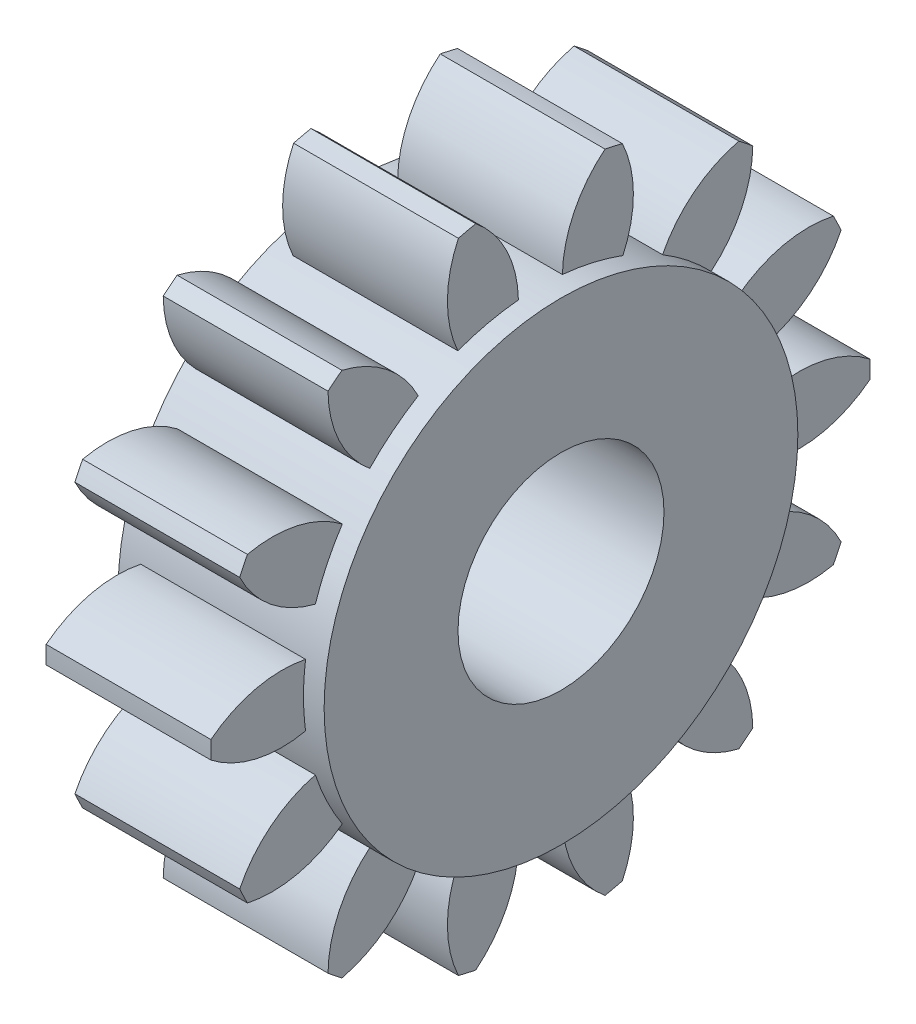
ISO-10303-21;
HEADER;
FILE_DESCRIPTION(('STEP AP214'),'2;1');
FILE_NAME('part.step','',(''),(''),'','','');
FILE_SCHEMA(('AUTOMOTIVE_DESIGN { 1 0 10303 214 1 1 1 1 }'));
ENDSEC;
DATA;
#1=APPLICATION_CONTEXT('core data for automotive mechanical design processes');
#2=APPLICATION_PROTOCOL_DEFINITION('international standard','automotive_design',2000,#1);
#3=PRODUCT_CONTEXT('',#1,'mechanical');
#4=PRODUCT('Part','Part','',(#3));
#5=PRODUCT_RELATED_PRODUCT_CATEGORY('part','',(#4));
#6=PRODUCT_DEFINITION_FORMATION('','',#4);
#7=PRODUCT_DEFINITION_CONTEXT('part definition',#1,'design');
#8=PRODUCT_DEFINITION('design','',#6,#7);
#9=PRODUCT_DEFINITION_SHAPE('','',#8);
#10=(LENGTH_UNIT() NAMED_UNIT(*) SI_UNIT(.MILLI.,.METRE.));
#11=(NAMED_UNIT(*) PLANE_ANGLE_UNIT() SI_UNIT($,.RADIAN.));
#12=(NAMED_UNIT(*) SI_UNIT($,.STERADIAN.) SOLID_ANGLE_UNIT());
#13=UNCERTAINTY_MEASURE_WITH_UNIT(LENGTH_MEASURE(1.E-05),#10,'distance_accuracy_value','');
#14=(GEOMETRIC_REPRESENTATION_CONTEXT(3) GLOBAL_UNCERTAINTY_ASSIGNED_CONTEXT((#13)) GLOBAL_UNIT_ASSIGNED_CONTEXT((#10,
#11,#12)) REPRESENTATION_CONTEXT('',''));
#15=CARTESIAN_POINT('',(0.,0.,0.));
#16=DIRECTION('',(0.,0.,1.));
#17=DIRECTION('',(1.,0.,0.));
#18=AXIS2_PLACEMENT_3D('',#15,#16,#17);
#19=CARTESIAN_POINT('',(8.,0.,0.));
#20=DIRECTION('',(-1.,0.,0.));
#21=DIRECTION('',(0.,0.,1.));
#22=AXIS2_PLACEMENT_3D('',#19,#20,#21);
#23=PLANE('',#22);
#24=CARTESIAN_POINT('',(8.,0.,0.));
#25=DIRECTION('',(1.,0.,0.));
#26=DIRECTION('',(0.,0.,-1.));
#27=AXIS2_PLACEMENT_3D('',#24,#25,#26);
#28=CIRCLE('',#27,11.499);
#29=CARTESIAN_POINT('',(8.,-3.58879572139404,10.9246302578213));
#30=VERTEX_POINT('',#29);
#31=CARTESIAN_POINT('',(8.,-6.30364233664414,9.61722903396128));
#32=VERTEX_POINT('',#31);
#33=EDGE_CURVE('E969',#30,#32,#28,.T.);
#34=ORIENTED_EDGE('',*,*,#33,.F.);
#35=CARTESIAN_POINT('',(8.,-9.02335085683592,9.57347871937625));
#36=DIRECTION('',(-1.,0.,0.));
#37=DIRECTION('',(0.,0.974927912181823,0.222520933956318));
#38=AXIS2_PLACEMENT_3D('',#35,#36,#37);
#39=CIRCLE('',#38,5.6);
#40=CARTESIAN_POINT('',(8.,-6.5501973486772,14.597770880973));
#41=VERTEX_POINT('',#40);
#42=EDGE_CURVE('E802',#41,#30,#39,.T.);
#43=ORIENTED_EDGE('',*,*,#42,.F.);
#44=CARTESIAN_POINT('',(8.,0.,0.));
#45=DIRECTION('',(-1.,0.,0.));
#46=DIRECTION('',(0.,0.,1.));
#47=AXIS2_PLACEMENT_3D('',#44,#45,#46);
#48=CIRCLE('',#47,16.);
#49=CARTESIAN_POINT('',(8.,-7.32901560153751,14.2227117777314));
#50=VERTEX_POINT('',#49);
#51=EDGE_CURVE('E876',#50,#41,#48,.T.);
#52=ORIENTED_EDGE('',*,*,#51,.F.);
#53=CARTESIAN_POINT('',(8.,-1.85887982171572,13.0237061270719));
#54=DIRECTION('',(-1.,0.,0.));
#55=DIRECTION('',(0.,0.781831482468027,0.623489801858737));
#56=AXIS2_PLACEMENT_3D('',#53,#54,#55);
#57=CIRCLE('',#56,5.6);
#58=EDGE_CURVE('E775',#32,#50,#57,.T.);
#59=ORIENTED_EDGE('',*,*,#58,.F.);
#60=EDGE_LOOP('',(#34,#43,#52,#59));
#61=FACE_BOUND('',#60,.T.);
#62=ADVANCED_FACE('F43',(#61),#23,.F.);
#63=CARTESIAN_POINT('',(8.,-7.97341264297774,8.28563164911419));
#64=VERTEX_POINT('',#63);
#65=CARTESIAN_POINT('',(8.,-9.85214479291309,5.92977604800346));
#66=VERTEX_POINT('',#65);
#67=EDGE_CURVE('E973',#64,#66,#28,.T.);
#68=ORIENTED_EDGE('',*,*,#67,.F.);
#69=CARTESIAN_POINT('',(8.,-12.2835349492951,4.71032107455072));
#70=DIRECTION('',(-1.,0.,0.));
#71=DIRECTION('',(0.,0.781831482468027,0.623489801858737));
#72=AXIS2_PLACEMENT_3D('',#69,#70,#71);
#73=CIRCLE('',#72,5.6);
#74=CARTESIAN_POINT('',(8.,-12.2352593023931,10.3101129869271));
#75=VERTEX_POINT('',#74);
#76=EDGE_CURVE('E777',#75,#64,#73,.T.);
#77=ORIENTED_EDGE('',*,*,#76,.F.);
#78=CARTESIAN_POINT('',(8.,-12.7742182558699,9.63427983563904));
#79=VERTEX_POINT('',#78);
#80=EDGE_CURVE('E882',#79,#75,#48,.T.);
#81=ORIENTED_EDGE('',*,*,#80,.F.);
#82=CARTESIAN_POINT('',(8.,-7.32556716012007,10.9274160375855));
#83=DIRECTION('',(-1.,0.,0.));
#84=DIRECTION('',(0.,0.433883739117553,0.900968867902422));
#85=AXIS2_PLACEMENT_3D('',#82,#83,#84);
#86=CIRCLE('',#85,5.6);
#87=EDGE_CURVE('E753',#66,#79,#86,.T.);
#88=ORIENTED_EDGE('',*,*,#87,.F.);
#89=EDGE_LOOP('',(#68,#77,#81,#88));
#90=FACE_BOUND('',#89,.T.);
#91=ADVANCED_FACE('F933',(#90),#23,.F.);
#92=CARTESIAN_POINT('',(8.,-10.7787974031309,4.00556207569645));
#93=VERTEX_POINT('',#92);
#94=CARTESIAN_POINT('',(8.,-11.4493091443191,1.06785819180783));
#95=VERTEX_POINT('',#94);
#96=EDGE_CURVE('E977',#93,#95,#28,.T.);
#97=ORIENTED_EDGE('',*,*,#96,.F.);
#98=CARTESIAN_POINT('',(8.,-13.1108142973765,-1.08577342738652));
#99=DIRECTION('',(-1.,0.,0.));
#100=DIRECTION('',(0.,0.433883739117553,0.900968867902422));
#101=AXIS2_PLACEMENT_3D('',#98,#99,#100);
#102=CIRCLE('',#101,5.6);
#103=CARTESIAN_POINT('',(8.,-15.4969780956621,3.98041077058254));
#104=VERTEX_POINT('',#103);
#105=EDGE_CURVE('E755',#104,#93,#102,.T.);
#106=ORIENTED_EDGE('',*,*,#105,.F.);
#107=CARTESIAN_POINT('',(8.,-15.6893303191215,3.13766061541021));
#108=VERTEX_POINT('',#107);
#109=EDGE_CURVE('E574',#108,#104,#48,.T.);
#110=ORIENTED_EDGE('',*,*,#109,.F.);
#111=CARTESIAN_POINT('',(8.,-11.3413360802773,6.66681718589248));
#112=DIRECTION('',(-1.,0.,0.));
#113=DIRECTION('',(0.,0.,1.));
#114=AXIS2_PLACEMENT_3D('',#111,#112,#113);
#115=CIRCLE('',#114,5.6);
#116=EDGE_CURVE('E765',#95,#108,#115,.T.);
#117=ORIENTED_EDGE('',*,*,#116,.F.);
#118=EDGE_LOOP('',(#97,#106,#110,#117));
#119=FACE_BOUND('',#118,.T.);
#120=ADVANCED_FACE('F939',(#119),#23,.F.);
#121=CARTESIAN_POINT('',(8.,-11.4493091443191,-1.06785819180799));
#122=VERTEX_POINT('',#121);
#123=CARTESIAN_POINT('',(8.,-10.7787974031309,-4.0055620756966));
#124=VERTEX_POINT('',#123);
#125=EDGE_CURVE('E908',#122,#124,#28,.T.);
#126=ORIENTED_EDGE('',*,*,#125,.F.);
#127=CARTESIAN_POINT('',(8.,-11.3413360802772,-6.66681718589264));
#128=DIRECTION('',(-1.,0.,0.));
#129=DIRECTION('',(0.,0.,1.));
#130=AXIS2_PLACEMENT_3D('',#127,#128,#129);
#131=CIRCLE('',#130,5.6);
#132=CARTESIAN_POINT('',(8.,-15.6893303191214,-3.13766061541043));
#133=VERTEX_POINT('',#132);
#134=EDGE_CURVE('E767',#133,#122,#131,.T.);
#135=ORIENTED_EDGE('',*,*,#134,.F.);
#136=CARTESIAN_POINT('',(8.,-15.496978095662,-3.98041077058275));
#137=VERTEX_POINT('',#136);
#138=EDGE_CURVE('E892',#137,#133,#48,.T.);
#139=ORIENTED_EDGE('',*,*,#138,.F.);
#140=CARTESIAN_POINT('',(8.,-13.1108142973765,1.08577342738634));
#141=DIRECTION('',(-1.,0.,0.));
#142=DIRECTION('',(0.,-0.433883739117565,0.900968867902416));
#143=AXIS2_PLACEMENT_3D('',#140,#141,#142);
#144=CIRCLE('',#143,5.6);
#145=EDGE_CURVE('E656',#124,#137,#144,.T.);
#146=ORIENTED_EDGE('',*,*,#145,.F.);
#147=EDGE_LOOP('',(#126,#135,#139,#146));
#148=FACE_BOUND('',#147,.T.);
#149=ADVANCED_FACE('F993',(#148),#23,.F.);
#150=CARTESIAN_POINT('',(8.,-9.85214479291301,-5.92977604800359));
#151=VERTEX_POINT('',#150);
#152=CARTESIAN_POINT('',(8.,-7.97341264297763,-8.2856316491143));
#153=VERTEX_POINT('',#152);
#154=EDGE_CURVE('E654',#151,#153,#28,.T.);
#155=ORIENTED_EDGE('',*,*,#154,.F.);
#156=CARTESIAN_POINT('',(8.,-7.32556716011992,-10.9274160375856));
#157=DIRECTION('',(-1.,0.,0.));
#158=DIRECTION('',(0.,-0.433883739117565,0.900968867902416));
#159=AXIS2_PLACEMENT_3D('',#156,#157,#158);
#160=CIRCLE('',#159,5.6);
#161=CARTESIAN_POINT('',(8.,-12.7742182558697,-9.63427983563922));
#162=VERTEX_POINT('',#161);
#163=EDGE_CURVE('E649',#162,#151,#160,.T.);
#164=ORIENTED_EDGE('',*,*,#163,.F.);
#165=CARTESIAN_POINT('',(8.,-12.235259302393,-10.3101129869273));
#166=VERTEX_POINT('',#165);
#167=EDGE_CURVE('E644',#166,#162,#48,.T.);
#168=ORIENTED_EDGE('',*,*,#167,.F.);
#169=CARTESIAN_POINT('',(8.,-12.2835349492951,-4.71032107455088));
#170=DIRECTION('',(-1.,0.,0.));
#171=DIRECTION('',(0.,-0.781831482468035,0.623489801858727));
#172=AXIS2_PLACEMENT_3D('',#169,#170,#171);
#173=CIRCLE('',#172,5.6);
#174=EDGE_CURVE('E724',#153,#166,#173,.T.);
#175=ORIENTED_EDGE('',*,*,#174,.F.);
#176=EDGE_LOOP('',(#155,#164,#168,#175));
#177=FACE_BOUND('',#176,.T.);
#178=ADVANCED_FACE('F652',(#177),#23,.F.);
#179=CARTESIAN_POINT('',(8.,-6.30364233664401,-9.61722903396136));
#180=VERTEX_POINT('',#179);
#181=CARTESIAN_POINT('',(8.,-3.5887957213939,-10.9246302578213));
#182=VERTEX_POINT('',#181);
#183=EDGE_CURVE('E907',#180,#182,#28,.T.);
#184=ORIENTED_EDGE('',*,*,#183,.F.);
#185=CARTESIAN_POINT('',(8.,-1.85887982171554,-13.0237061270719));
#186=DIRECTION('',(-1.,0.,0.));
#187=DIRECTION('',(0.,-0.781831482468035,0.623489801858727));
#188=AXIS2_PLACEMENT_3D('',#185,#186,#187);
#189=CIRCLE('',#188,5.6);
#190=CARTESIAN_POINT('',(8.,-7.32901560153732,-14.2227117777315));
#191=VERTEX_POINT('',#190);
#192=EDGE_CURVE('E726',#191,#180,#189,.T.);
#193=ORIENTED_EDGE('',*,*,#192,.F.);
#194=CARTESIAN_POINT('',(8.,-6.550197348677,-14.5977708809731));
#195=VERTEX_POINT('',#194);
#196=EDGE_CURVE('E898',#195,#191,#48,.T.);
#197=ORIENTED_EDGE('',*,*,#196,.F.);
#198=CARTESIAN_POINT('',(8.,-9.02335085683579,-9.57347871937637));
#199=DIRECTION('',(-1.,0.,0.));
#200=DIRECTION('',(0.,-0.974927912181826,0.222520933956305));
#201=AXIS2_PLACEMENT_3D('',#198,#199,#200);
#202=CIRCLE('',#201,5.6);
#203=EDGE_CURVE('E431',#182,#195,#202,.T.);
#204=ORIENTED_EDGE('',*,*,#203,.F.);
#205=EDGE_LOOP('',(#184,#193,#197,#204));
#206=FACE_BOUND('',#205,.T.);
#207=ADVANCED_FACE('F906',(#206),#23,.F.);
#208=CARTESIAN_POINT('',(8.,-1.5066262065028,-11.3998718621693));
#209=VERTEX_POINT('',#208);
#210=CARTESIAN_POINT('',(8.,1.50662620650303,-11.3998718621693));
#211=VERTEX_POINT('',#210);
#212=EDGE_CURVE('E414',#209,#211,#28,.T.);
#213=ORIENTED_EDGE('',*,*,#212,.F.);
#214=CARTESIAN_POINT('',(8.,3.97598146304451,-12.5404914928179));
#215=DIRECTION('',(-1.,0.,0.));
#216=DIRECTION('',(0.,-0.974927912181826,0.222520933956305));
#217=AXIS2_PLACEMENT_3D('',#214,#215,#216);
#218=CIRCLE('',#217,5.6);
#219=CARTESIAN_POINT('',(8.,-0.432211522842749,-15.9941612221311));
#220=VERTEX_POINT('',#219);
#221=EDGE_CURVE('E710',#220,#209,#218,.T.);
#222=ORIENTED_EDGE('',*,*,#221,.F.);
#223=CARTESIAN_POINT('',(8.,0.432211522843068,-15.9941612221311));
#224=VERTEX_POINT('',#223);
#225=EDGE_CURVE('E705',#224,#220,#48,.T.);
#226=ORIENTED_EDGE('',*,*,#225,.F.);
#227=CARTESIAN_POINT('',(8.,-3.97598146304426,-12.540491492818));
#228=DIRECTION('',(-1.,0.,0.));
#229=DIRECTION('',(0.,-0.974927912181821,-0.222520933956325));
#230=AXIS2_PLACEMENT_3D('',#227,#228,#229);
#231=CIRCLE('',#230,5.6);
#232=EDGE_CURVE('E422',#211,#224,#231,.T.);
#233=ORIENTED_EDGE('',*,*,#232,.F.);
#234=EDGE_LOOP('',(#213,#222,#226,#233));
#235=FACE_BOUND('',#234,.T.);
#236=ADVANCED_FACE('F713',(#235),#23,.F.);
#237=CARTESIAN_POINT('',(8.,3.58879572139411,-10.9246302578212));
#238=VERTEX_POINT('',#237);
#239=CARTESIAN_POINT('',(8.,6.30364233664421,-9.61722903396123));
#240=VERTEX_POINT('',#239);
#241=EDGE_CURVE('E400',#238,#240,#28,.T.);
#242=ORIENTED_EDGE('',*,*,#241,.F.);
#243=CARTESIAN_POINT('',(8.,9.02335085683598,-9.57347871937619));
#244=DIRECTION('',(-1.,0.,0.));
#245=DIRECTION('',(0.,-0.974927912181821,-0.222520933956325));
#246=AXIS2_PLACEMENT_3D('',#243,#244,#245);
#247=CIRCLE('',#246,5.6);
#248=CARTESIAN_POINT('',(8.,6.55019734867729,-14.5977708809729));
#249=VERTEX_POINT('',#248);
#250=EDGE_CURVE('E404',#249,#238,#247,.T.);
#251=ORIENTED_EDGE('',*,*,#250,.F.);
#252=CARTESIAN_POINT('',(8.,7.32901560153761,-14.2227117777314));
#253=VERTEX_POINT('',#252);
#254=EDGE_CURVE('E860',#253,#249,#48,.T.);
#255=ORIENTED_EDGE('',*,*,#254,.F.);
#256=CARTESIAN_POINT('',(8.,1.85887982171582,-13.0237061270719));
#257=DIRECTION('',(-1.,0.,0.));
#258=DIRECTION('',(0.,-0.781831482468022,-0.623489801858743));
#259=AXIS2_PLACEMENT_3D('',#256,#257,#258);
#260=CIRCLE('',#259,5.6);
#261=EDGE_CURVE('E406',#240,#253,#260,.T.);
#262=ORIENTED_EDGE('',*,*,#261,.F.);
#263=EDGE_LOOP('',(#242,#251,#255,#262));
#264=FACE_BOUND('',#263,.T.);
#265=ADVANCED_FACE('F402',(#264),#23,.F.);
#266=CARTESIAN_POINT('',(8.,7.97341264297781,-8.28563164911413));
#267=VERTEX_POINT('',#266);
#268=CARTESIAN_POINT('',(8.,9.85214479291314,-5.92977604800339));
#269=VERTEX_POINT('',#268);
#270=EDGE_CURVE('E412',#267,#269,#28,.T.);
#271=ORIENTED_EDGE('',*,*,#270,.F.);
#272=CARTESIAN_POINT('',(8.,12.2835349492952,-4.71032107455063));
#273=DIRECTION('',(-1.,0.,0.));
#274=DIRECTION('',(0.,-0.781831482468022,-0.623489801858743));
#275=AXIS2_PLACEMENT_3D('',#272,#273,#274);
#276=CIRCLE('',#275,5.6);
#277=CARTESIAN_POINT('',(8.,12.2352593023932,-10.310112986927));
#278=VERTEX_POINT('',#277);
#279=EDGE_CURVE('E684',#278,#267,#276,.T.);
#280=ORIENTED_EDGE('',*,*,#279,.F.);
#281=CARTESIAN_POINT('',(8.,12.7742182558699,-9.63427983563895));
#282=VERTEX_POINT('',#281);
#283=EDGE_CURVE('E532',#282,#278,#48,.T.);
#284=ORIENTED_EDGE('',*,*,#283,.F.);
#285=CARTESIAN_POINT('',(8.,7.32556716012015,-10.9274160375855));
#286=DIRECTION('',(-1.,0.,0.));
#287=DIRECTION('',(0.,-0.433883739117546,-0.900968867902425));
#288=AXIS2_PLACEMENT_3D('',#285,#286,#287);
#289=CIRCLE('',#288,5.6);
#290=EDGE_CURVE('E669',#269,#282,#289,.T.);
#291=ORIENTED_EDGE('',*,*,#290,.F.);
#292=EDGE_LOOP('',(#271,#280,#284,#291));
#293=FACE_BOUND('',#292,.T.);
#294=ADVANCED_FACE('F859',(#293),#23,.F.);
#295=CARTESIAN_POINT('',(8.,10.778797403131,-4.00556207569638));
#296=VERTEX_POINT('',#295);
#297=CARTESIAN_POINT('',(8.,11.4493091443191,-1.06785819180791));
#298=VERTEX_POINT('',#297);
#299=EDGE_CURVE('E1122',#296,#298,#28,.T.);
#300=ORIENTED_EDGE('',*,*,#299,.F.);
#301=CARTESIAN_POINT('',(8.,13.1108142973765,1.08577342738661));
#302=DIRECTION('',(-1.,0.,0.));
#303=DIRECTION('',(0.,-0.433883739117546,-0.900968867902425));
#304=AXIS2_PLACEMENT_3D('',#301,#302,#303);
#305=CIRCLE('',#304,5.6);
#306=CARTESIAN_POINT('',(8.,15.4969780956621,-3.98041077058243));
#307=VERTEX_POINT('',#306);
#308=EDGE_CURVE('E671',#307,#296,#305,.T.);
#309=ORIENTED_EDGE('',*,*,#308,.F.);
#310=CARTESIAN_POINT('',(8.,15.6893303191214,-3.13766061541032));
#311=VERTEX_POINT('',#310);
#312=EDGE_CURVE('E528',#311,#307,#48,.T.);
#313=ORIENTED_EDGE('',*,*,#312,.F.);
#314=CARTESIAN_POINT('',(8.,11.3413360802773,-6.66681718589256));
#315=DIRECTION('',(-1.,0.,0.));
#316=DIRECTION('',(0.,0.,-1.));
#317=AXIS2_PLACEMENT_3D('',#314,#315,#316);
#318=CIRCLE('',#317,5.6);
#319=EDGE_CURVE('E504',#298,#311,#318,.T.);
#320=ORIENTED_EDGE('',*,*,#319,.F.);
#321=EDGE_LOOP('',(#300,#309,#313,#320));
#322=FACE_BOUND('',#321,.T.);
#323=ADVANCED_FACE('F1446',(#322),#23,.F.);
#324=CARTESIAN_POINT('',(8.,11.4493091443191,1.06785819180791));
#325=VERTEX_POINT('',#324);
#326=CARTESIAN_POINT('',(8.,10.7787974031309,4.00556207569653));
#327=VERTEX_POINT('',#326);
#328=EDGE_CURVE('E968',#325,#327,#28,.T.);
#329=ORIENTED_EDGE('',*,*,#328,.F.);
#330=CARTESIAN_POINT('',(8.,11.3413360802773,6.66681718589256));
#331=DIRECTION('',(-1.,0.,0.));
#332=DIRECTION('',(0.,0.,-1.));
#333=AXIS2_PLACEMENT_3D('',#330,#331,#332);
#334=CIRCLE('',#333,5.6);
#335=CARTESIAN_POINT('',(8.,15.6893303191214,3.13766061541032));
#336=VERTEX_POINT('',#335);
#337=EDGE_CURVE('E506',#336,#325,#334,.T.);
#338=ORIENTED_EDGE('',*,*,#337,.F.);
#339=CARTESIAN_POINT('',(8.,15.4969780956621,3.98041077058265));
#340=VERTEX_POINT('',#339);
#341=EDGE_CURVE('E525',#340,#336,#48,.T.);
#342=ORIENTED_EDGE('',*,*,#341,.F.);
#343=CARTESIAN_POINT('',(8.,13.1108142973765,-1.08577342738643));
#344=DIRECTION('',(-1.,0.,0.));
#345=DIRECTION('',(0.,0.433883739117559,-0.900968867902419));
#346=AXIS2_PLACEMENT_3D('',#343,#344,#345);
#347=CIRCLE('',#346,5.6);
#348=EDGE_CURVE('E486',#327,#340,#347,.T.);
#349=ORIENTED_EDGE('',*,*,#348,.F.);
#350=EDGE_LOOP('',(#329,#338,#342,#349));
#351=FACE_BOUND('',#350,.T.);
#352=ADVANCED_FACE('F962',(#351),#23,.F.);
#353=CARTESIAN_POINT('',(8.,9.85214479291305,5.92977604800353));
#354=VERTEX_POINT('',#353);
#355=CARTESIAN_POINT('',(8.,7.97341264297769,8.28563164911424));
#356=VERTEX_POINT('',#355);
#357=EDGE_CURVE('E966',#354,#356,#28,.T.);
#358=ORIENTED_EDGE('',*,*,#357,.F.);
#359=CARTESIAN_POINT('',(8.,7.32556716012,10.9274160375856));
#360=DIRECTION('',(-1.,0.,0.));
#361=DIRECTION('',(0.,0.433883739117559,-0.900968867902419));
#362=AXIS2_PLACEMENT_3D('',#359,#360,#361);
#363=CIRCLE('',#362,5.6);
#364=CARTESIAN_POINT('',(8.,12.7742182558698,9.63427983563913));
#365=VERTEX_POINT('',#364);
#366=EDGE_CURVE('E488',#365,#354,#363,.T.);
#367=ORIENTED_EDGE('',*,*,#366,.F.);
#368=CARTESIAN_POINT('',(8.,12.235259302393,10.3101129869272));
#369=VERTEX_POINT('',#368);
#370=EDGE_CURVE('E533',#369,#365,#48,.T.);
#371=ORIENTED_EDGE('',*,*,#370,.F.);
#372=CARTESIAN_POINT('',(8.,12.2835349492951,4.7103210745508));
#373=DIRECTION('',(-1.,0.,0.));
#374=DIRECTION('',(0.,0.781831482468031,-0.623489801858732));
#375=AXIS2_PLACEMENT_3D('',#372,#373,#374);
#376=CIRCLE('',#375,5.6);
#377=EDGE_CURVE('E810',#356,#369,#376,.T.);
#378=ORIENTED_EDGE('',*,*,#377,.F.);
#379=EDGE_LOOP('',(#358,#367,#371,#378));
#380=FACE_BOUND('',#379,.T.);
#381=ADVANCED_FACE('F955',(#380),#23,.F.);
#382=CARTESIAN_POINT('',(8.,6.30364233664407,9.61722903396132));
#383=VERTEX_POINT('',#382);
#384=CARTESIAN_POINT('',(8.,3.58879572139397,10.9246302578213));
#385=VERTEX_POINT('',#384);
#386=EDGE_CURVE('E965',#383,#385,#28,.T.);
#387=ORIENTED_EDGE('',*,*,#386,.F.);
#388=CARTESIAN_POINT('',(8.,1.85887982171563,13.0237061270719));
#389=DIRECTION('',(-1.,0.,0.));
#390=DIRECTION('',(0.,0.781831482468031,-0.623489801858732));
#391=AXIS2_PLACEMENT_3D('',#388,#389,#390);
#392=CIRCLE('',#391,5.6);
#393=CARTESIAN_POINT('',(8.,7.32901560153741,14.2227117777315));
#394=VERTEX_POINT('',#393);
#395=EDGE_CURVE('E812',#394,#383,#392,.T.);
#396=ORIENTED_EDGE('',*,*,#395,.F.);
#397=CARTESIAN_POINT('',(8.,6.5501973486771,14.597770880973));
#398=VERTEX_POINT('',#397);
#399=EDGE_CURVE('E865',#398,#394,#48,.T.);
#400=ORIENTED_EDGE('',*,*,#399,.F.);
#401=CARTESIAN_POINT('',(8.,9.02335085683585,9.57347871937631));
#402=DIRECTION('',(-1.,0.,0.));
#403=DIRECTION('',(0.,0.974927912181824,-0.222520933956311));
#404=AXIS2_PLACEMENT_3D('',#401,#402,#403);
#405=CIRCLE('',#404,5.6);
#406=EDGE_CURVE('E786',#385,#398,#405,.T.);
#407=ORIENTED_EDGE('',*,*,#406,.F.);
#408=EDGE_LOOP('',(#387,#396,#400,#407));
#409=FACE_BOUND('',#408,.T.);
#410=ADVANCED_FACE('F945',(#409),#23,.F.);
#411=CARTESIAN_POINT('',(0.,0.,0.));
#412=DIRECTION('',(1.,0.,0.));
#413=DIRECTION('',(0.,0.,-1.));
#414=AXIS2_PLACEMENT_3D('',#411,#412,#413);
#415=PLANE('',#414);
#416=CARTESIAN_POINT('',(0.,0.,0.));
#417=DIRECTION('',(-1.,0.,0.));
#418=DIRECTION('',(0.,0.,1.));
#419=AXIS2_PLACEMENT_3D('',#416,#417,#418);
#420=CIRCLE('',#419,11.499);
#421=CARTESIAN_POINT('',(0.,-3.5887957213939,-10.9246302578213));
#422=VERTEX_POINT('',#421);
#423=CARTESIAN_POINT('',(0.,-6.303642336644,-9.61722903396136));
#424=VERTEX_POINT('',#423);
#425=EDGE_CURVE('E740',#422,#424,#420,.T.);
#426=ORIENTED_EDGE('',*,*,#425,.F.);
#427=CARTESIAN_POINT('',(0.,-9.02335085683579,-9.57347871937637));
#428=DIRECTION('',(-1.,0.,0.));
#429=DIRECTION('',(0.,-0.974927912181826,0.222520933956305));
#430=AXIS2_PLACEMENT_3D('',#427,#428,#429);
#431=CIRCLE('',#430,5.6);
#432=CARTESIAN_POINT('',(0.,-6.550197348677,-14.5977708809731));
#433=VERTEX_POINT('',#432);
#434=EDGE_CURVE('E428',#422,#433,#431,.T.);
#435=ORIENTED_EDGE('',*,*,#434,.T.);
#436=CARTESIAN_POINT('',(0.,0.,0.));
#437=DIRECTION('',(-1.,0.,0.));
#438=DIRECTION('',(0.,0.,1.));
#439=AXIS2_PLACEMENT_3D('',#436,#437,#438);
#440=CIRCLE('',#439,16.);
#441=CARTESIAN_POINT('',(0.,-7.32901560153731,-14.2227117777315));
#442=VERTEX_POINT('',#441);
#443=EDGE_CURVE('E620',#433,#442,#440,.T.);
#444=ORIENTED_EDGE('',*,*,#443,.T.);
#445=CARTESIAN_POINT('',(0.,-1.85887982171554,-13.0237061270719));
#446=DIRECTION('',(1.,0.,0.));
#447=DIRECTION('',(0.,0.,-1.));
#448=AXIS2_PLACEMENT_3D('',#445,#446,#447);
#449=CIRCLE('',#448,5.6);
#450=EDGE_CURVE('E549',#424,#442,#449,.T.);
#451=ORIENTED_EDGE('',*,*,#450,.F.);
#452=EDGE_LOOP('',(#426,#435,#444,#451));
#453=FACE_BOUND('',#452,.T.);
#454=ADVANCED_FACE('F739',(#453),#415,.F.);
#455=CARTESIAN_POINT('',(0.,-7.97341264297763,-8.2856316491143));
#456=VERTEX_POINT('',#455);
#457=CARTESIAN_POINT('',(0.,-9.85214479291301,-5.92977604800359));
#458=VERTEX_POINT('',#457);
#459=EDGE_CURVE('E744',#456,#458,#420,.T.);
#460=ORIENTED_EDGE('',*,*,#459,.F.);
#461=CARTESIAN_POINT('',(0.,-12.2835349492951,-4.71032107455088));
#462=DIRECTION('',(-1.,0.,0.));
#463=DIRECTION('',(0.,-0.781831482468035,0.623489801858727));
#464=AXIS2_PLACEMENT_3D('',#461,#462,#463);
#465=CIRCLE('',#464,5.6);
#466=CARTESIAN_POINT('',(0.,-12.235259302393,-10.3101129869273));
#467=VERTEX_POINT('',#466);
#468=EDGE_CURVE('E637',#456,#467,#465,.T.);
#469=ORIENTED_EDGE('',*,*,#468,.T.);
#470=CARTESIAN_POINT('',(0.,-12.7742182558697,-9.63427983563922));
#471=VERTEX_POINT('',#470);
#472=EDGE_CURVE('E580',#467,#471,#440,.T.);
#473=ORIENTED_EDGE('',*,*,#472,.T.);
#474=CARTESIAN_POINT('',(0.,-7.32556716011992,-10.9274160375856));
#475=DIRECTION('',(1.,0.,0.));
#476=DIRECTION('',(0.,0.,-1.));
#477=AXIS2_PLACEMENT_3D('',#474,#475,#476);
#478=CIRCLE('',#477,5.6);
#479=EDGE_CURVE('E545',#458,#471,#478,.T.);
#480=ORIENTED_EDGE('',*,*,#479,.F.);
#481=EDGE_LOOP('',(#460,#469,#473,#480));
#482=FACE_BOUND('',#481,.T.);
#483=ADVANCED_FACE('F634',(#482),#415,.F.);
#484=CARTESIAN_POINT('',(0.,-10.7787974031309,-4.0055620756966));
#485=VERTEX_POINT('',#484);
#486=CARTESIAN_POINT('',(0.,-11.4493091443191,-1.06785819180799));
#487=VERTEX_POINT('',#486);
#488=EDGE_CURVE('E746',#485,#487,#420,.T.);
#489=ORIENTED_EDGE('',*,*,#488,.F.);
#490=CARTESIAN_POINT('',(0.,-13.1108142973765,1.08577342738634));
#491=DIRECTION('',(-1.,0.,0.));
#492=DIRECTION('',(0.,-0.433883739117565,0.900968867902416));
#493=AXIS2_PLACEMENT_3D('',#490,#491,#492);
#494=CIRCLE('',#493,5.6);
#495=CARTESIAN_POINT('',(0.,-15.496978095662,-3.98041077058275));
#496=VERTEX_POINT('',#495);
#497=EDGE_CURVE('E661',#485,#496,#494,.T.);
#498=ORIENTED_EDGE('',*,*,#497,.T.);
#499=CARTESIAN_POINT('',(0.,-15.6893303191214,-3.13766061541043));
#500=VERTEX_POINT('',#499);
#501=EDGE_CURVE('E577',#496,#500,#440,.T.);
#502=ORIENTED_EDGE('',*,*,#501,.T.);
#503=CARTESIAN_POINT('',(0.,-11.3413360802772,-6.66681718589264));
#504=DIRECTION('',(1.,0.,0.));
#505=DIRECTION('',(0.,0.,-1.));
#506=AXIS2_PLACEMENT_3D('',#503,#504,#505);
#507=CIRCLE('',#506,5.6);
#508=EDGE_CURVE('E557',#487,#500,#507,.T.);
#509=ORIENTED_EDGE('',*,*,#508,.F.);
#510=EDGE_LOOP('',(#489,#498,#502,#509));
#511=FACE_BOUND('',#510,.T.);
#512=ADVANCED_FACE('F1000',(#511),#415,.F.);
#513=CARTESIAN_POINT('',(0.,-11.4493091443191,1.06785819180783));
#514=VERTEX_POINT('',#513);
#515=CARTESIAN_POINT('',(0.,-10.7787974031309,4.00556207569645));
#516=VERTEX_POINT('',#515);
#517=EDGE_CURVE('E67',#514,#516,#420,.T.);
#518=ORIENTED_EDGE('',*,*,#517,.F.);
#519=CARTESIAN_POINT('',(0.,-11.3413360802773,6.66681718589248));
#520=DIRECTION('',(-1.,0.,0.));
#521=DIRECTION('',(0.,0.,1.));
#522=AXIS2_PLACEMENT_3D('',#519,#520,#521);
#523=CIRCLE('',#522,5.6);
#524=CARTESIAN_POINT('',(0.,-15.6893303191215,3.13766061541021));
#525=VERTEX_POINT('',#524);
#526=EDGE_CURVE('E576',#514,#525,#523,.T.);
#527=ORIENTED_EDGE('',*,*,#526,.T.);
#528=CARTESIAN_POINT('',(0.,-15.4969780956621,3.98041077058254));
#529=VERTEX_POINT('',#528);
#530=EDGE_CURVE('E572',#525,#529,#440,.T.);
#531=ORIENTED_EDGE('',*,*,#530,.T.);
#532=CARTESIAN_POINT('',(0.,-13.1108142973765,-1.08577342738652));
#533=DIRECTION('',(1.,0.,0.));
#534=DIRECTION('',(0.,0.,-1.));
#535=AXIS2_PLACEMENT_3D('',#532,#533,#534);
#536=CIRCLE('',#535,5.6);
#537=EDGE_CURVE('E52',#516,#529,#536,.T.);
#538=ORIENTED_EDGE('',*,*,#537,.F.);
#539=EDGE_LOOP('',(#518,#527,#531,#538));
#540=FACE_BOUND('',#539,.T.);
#541=ADVANCED_FACE('F575',(#540),#415,.F.);
#542=CARTESIAN_POINT('',(0.,-9.85214479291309,5.92977604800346));
#543=VERTEX_POINT('',#542);
#544=CARTESIAN_POINT('',(0.,-7.97341264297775,8.28563164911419));
#545=VERTEX_POINT('',#544);
#546=EDGE_CURVE('E59',#543,#545,#420,.T.);
#547=ORIENTED_EDGE('',*,*,#546,.F.);
#548=CARTESIAN_POINT('',(0.,-7.32556716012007,10.9274160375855));
#549=DIRECTION('',(-1.,0.,0.));
#550=DIRECTION('',(0.,0.433883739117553,0.900968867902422));
#551=AXIS2_PLACEMENT_3D('',#548,#549,#550);
#552=CIRCLE('',#551,5.6);
#553=CARTESIAN_POINT('',(0.,-12.7742182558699,9.63427983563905));
#554=VERTEX_POINT('',#553);
#555=EDGE_CURVE('E756',#543,#554,#552,.T.);
#556=ORIENTED_EDGE('',*,*,#555,.T.);
#557=CARTESIAN_POINT('',(0.,-12.2352593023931,10.3101129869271));
#558=VERTEX_POINT('',#557);
#559=EDGE_CURVE('E578',#554,#558,#440,.T.);
#560=ORIENTED_EDGE('',*,*,#559,.T.);
#561=CARTESIAN_POINT('',(0.,-12.2835349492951,4.71032107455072));
#562=DIRECTION('',(1.,0.,0.));
#563=DIRECTION('',(0.,0.,-1.));
#564=AXIS2_PLACEMENT_3D('',#561,#562,#563);
#565=CIRCLE('',#564,5.6);
#566=EDGE_CURVE('E11',#545,#558,#565,.T.);
#567=ORIENTED_EDGE('',*,*,#566,.F.);
#568=EDGE_LOOP('',(#547,#556,#560,#567));
#569=FACE_BOUND('',#568,.T.);
#570=ADVANCED_FACE('F1169',(#569),#415,.F.);
#571=CARTESIAN_POINT('',(0.,-6.30364233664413,9.61722903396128));
#572=VERTEX_POINT('',#571);
#573=CARTESIAN_POINT('',(0.,-3.58879572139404,10.9246302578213));
#574=VERTEX_POINT('',#573);
#575=EDGE_CURVE('E751',#572,#574,#420,.T.);
#576=ORIENTED_EDGE('',*,*,#575,.F.);
#577=CARTESIAN_POINT('',(0.,-1.85887982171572,13.0237061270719));
#578=DIRECTION('',(-1.,0.,0.));
#579=DIRECTION('',(0.,0.781831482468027,0.623489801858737));
#580=AXIS2_PLACEMENT_3D('',#577,#578,#579);
#581=CIRCLE('',#580,5.6);
#582=CARTESIAN_POINT('',(0.,-7.32901560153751,14.2227117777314));
#583=VERTEX_POINT('',#582);
#584=EDGE_CURVE('E764',#572,#583,#581,.T.);
#585=ORIENTED_EDGE('',*,*,#584,.T.);
#586=CARTESIAN_POINT('',(0.,-6.5501973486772,14.597770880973));
#587=VERTEX_POINT('',#586);
#588=EDGE_CURVE('E582',#583,#587,#440,.T.);
#589=ORIENTED_EDGE('',*,*,#588,.T.);
#590=CARTESIAN_POINT('',(0.,-9.02335085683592,9.57347871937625));
#591=DIRECTION('',(1.,0.,0.));
#592=DIRECTION('',(0.,0.,-1.));
#593=AXIS2_PLACEMENT_3D('',#590,#591,#592);
#594=CIRCLE('',#593,5.6);
#595=EDGE_CURVE('E551',#574,#587,#594,.T.);
#596=ORIENTED_EDGE('',*,*,#595,.F.);
#597=EDGE_LOOP('',(#576,#585,#589,#596));
#598=FACE_BOUND('',#597,.T.);
#599=ADVANCED_FACE('F1004',(#598),#415,.F.);
#600=CARTESIAN_POINT('',(0.,-1.50662620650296,11.3998718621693));
#601=VERTEX_POINT('',#600);
#602=CARTESIAN_POINT('',(0.,1.50662620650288,11.3998718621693));
#603=VERTEX_POINT('',#602);
#604=EDGE_CURVE('E747',#601,#603,#420,.T.);
#605=ORIENTED_EDGE('',*,*,#604,.F.);
#606=CARTESIAN_POINT('',(0.,3.97598146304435,12.5404914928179));
#607=DIRECTION('',(-1.,0.,0.));
#608=DIRECTION('',(0.,0.974927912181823,0.222520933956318));
#609=AXIS2_PLACEMENT_3D('',#606,#607,#608);
#610=CIRCLE('',#609,5.6);
#611=CARTESIAN_POINT('',(0.,-0.432211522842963,15.9941612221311));
#612=VERTEX_POINT('',#611);
#613=EDGE_CURVE('E785',#601,#612,#610,.T.);
#614=ORIENTED_EDGE('',*,*,#613,.T.);
#615=CARTESIAN_POINT('',(0.,0.432211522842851,15.9941612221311));
#616=VERTEX_POINT('',#615);
#617=EDGE_CURVE('E585',#612,#616,#440,.T.);
#618=ORIENTED_EDGE('',*,*,#617,.T.);
#619=CARTESIAN_POINT('',(0.,-3.97598146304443,12.5404914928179));
#620=DIRECTION('',(1.,0.,0.));
#621=DIRECTION('',(0.,0.,-1.));
#622=AXIS2_PLACEMENT_3D('',#619,#620,#621);
#623=CIRCLE('',#622,5.6);
#624=EDGE_CURVE('E553',#603,#616,#623,.T.);
#625=ORIENTED_EDGE('',*,*,#624,.F.);
#626=EDGE_LOOP('',(#605,#614,#618,#625));
#627=FACE_BOUND('',#626,.T.);
#628=ADVANCED_FACE('F1141',(#627),#415,.F.);
#629=CARTESIAN_POINT('',(0.,3.58879572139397,10.9246302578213));
#630=VERTEX_POINT('',#629);
#631=CARTESIAN_POINT('',(0.,6.30364233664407,9.61722903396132));
#632=VERTEX_POINT('',#631);
#633=EDGE_CURVE('E752',#630,#632,#420,.T.);
#634=ORIENTED_EDGE('',*,*,#633,.F.);
#635=CARTESIAN_POINT('',(0.,9.02335085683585,9.57347871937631));
#636=DIRECTION('',(-1.,0.,0.));
#637=DIRECTION('',(0.,0.974927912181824,-0.222520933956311));
#638=AXIS2_PLACEMENT_3D('',#635,#636,#637);
#639=CIRCLE('',#638,5.6);
#640=CARTESIAN_POINT('',(0.,6.5501973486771,14.597770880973));
#641=VERTEX_POINT('',#640);
#642=EDGE_CURVE('E789',#630,#641,#639,.T.);
#643=ORIENTED_EDGE('',*,*,#642,.T.);
#644=CARTESIAN_POINT('',(0.,7.32901560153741,14.2227117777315));
#645=VERTEX_POINT('',#644);
#646=EDGE_CURVE('E591',#641,#645,#440,.T.);
#647=ORIENTED_EDGE('',*,*,#646,.T.);
#648=CARTESIAN_POINT('',(0.,1.85887982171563,13.0237061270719));
#649=DIRECTION('',(1.,0.,0.));
#650=DIRECTION('',(0.,0.,-1.));
#651=AXIS2_PLACEMENT_3D('',#648,#649,#650);
#652=CIRCLE('',#651,5.6);
#653=EDGE_CURVE('E555',#632,#645,#652,.T.);
#654=ORIENTED_EDGE('',*,*,#653,.F.);
#655=EDGE_LOOP('',(#634,#643,#647,#654));
#656=FACE_BOUND('',#655,.T.);
#657=ADVANCED_FACE('F825',(#656),#415,.F.);
#658=CARTESIAN_POINT('',(0.,7.97341264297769,8.28563164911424));
#659=VERTEX_POINT('',#658);
#660=CARTESIAN_POINT('',(0.,9.85214479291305,5.92977604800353));
#661=VERTEX_POINT('',#660);
#662=EDGE_CURVE('E829',#659,#661,#420,.T.);
#663=ORIENTED_EDGE('',*,*,#662,.F.);
#664=CARTESIAN_POINT('',(0.,12.2835349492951,4.7103210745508));
#665=DIRECTION('',(-1.,0.,0.));
#666=DIRECTION('',(0.,0.781831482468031,-0.623489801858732));
#667=AXIS2_PLACEMENT_3D('',#664,#665,#666);
#668=CIRCLE('',#667,5.6);
#669=CARTESIAN_POINT('',(0.,12.235259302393,10.3101129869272));
#670=VERTEX_POINT('',#669);
#671=EDGE_CURVE('E799',#659,#670,#668,.T.);
#672=ORIENTED_EDGE('',*,*,#671,.T.);
#673=CARTESIAN_POINT('',(0.,12.7742182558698,9.63427983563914));
#674=VERTEX_POINT('',#673);
#675=EDGE_CURVE('E527',#670,#674,#440,.T.);
#676=ORIENTED_EDGE('',*,*,#675,.T.);
#677=CARTESIAN_POINT('',(0.,7.32556716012,10.9274160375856));
#678=DIRECTION('',(1.,0.,0.));
#679=DIRECTION('',(0.,0.,-1.));
#680=AXIS2_PLACEMENT_3D('',#677,#678,#679);
#681=CIRCLE('',#680,5.6);
#682=EDGE_CURVE('E536',#661,#674,#681,.T.);
#683=ORIENTED_EDGE('',*,*,#682,.F.);
#684=EDGE_LOOP('',(#663,#672,#676,#683));
#685=FACE_BOUND('',#684,.T.);
#686=ADVANCED_FACE('F1131',(#685),#415,.F.);
#687=CARTESIAN_POINT('',(0.,10.7787974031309,4.00556207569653));
#688=VERTEX_POINT('',#687);
#689=CARTESIAN_POINT('',(0.,11.4493091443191,1.06785819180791));
#690=VERTEX_POINT('',#689);
#691=EDGE_CURVE('E832',#688,#690,#420,.T.);
#692=ORIENTED_EDGE('',*,*,#691,.F.);
#693=CARTESIAN_POINT('',(0.,13.1108142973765,-1.08577342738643));
#694=DIRECTION('',(-1.,0.,0.));
#695=DIRECTION('',(0.,0.433883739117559,-0.900968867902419));
#696=AXIS2_PLACEMENT_3D('',#693,#694,#695);
#697=CIRCLE('',#696,5.6);
#698=CARTESIAN_POINT('',(0.,15.4969780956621,3.98041077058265));
#699=VERTEX_POINT('',#698);
#700=EDGE_CURVE('E485',#688,#699,#697,.T.);
#701=ORIENTED_EDGE('',*,*,#700,.T.);
#702=CARTESIAN_POINT('',(0.,15.6893303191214,3.13766061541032));
#703=VERTEX_POINT('',#702);
#704=EDGE_CURVE('E521',#699,#703,#440,.T.);
#705=ORIENTED_EDGE('',*,*,#704,.T.);
#706=CARTESIAN_POINT('',(0.,11.3413360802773,6.66681718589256));
#707=DIRECTION('',(1.,0.,0.));
#708=DIRECTION('',(0.,0.,-1.));
#709=AXIS2_PLACEMENT_3D('',#706,#707,#708);
#710=CIRCLE('',#709,5.6);
#711=EDGE_CURVE('E531',#690,#703,#710,.T.);
#712=ORIENTED_EDGE('',*,*,#711,.F.);
#713=EDGE_LOOP('',(#692,#701,#705,#712));
#714=FACE_BOUND('',#713,.T.);
#715=ADVANCED_FACE('F1129',(#714),#415,.F.);
#716=CARTESIAN_POINT('',(0.,11.4493091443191,-1.06785819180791));
#717=VERTEX_POINT('',#716);
#718=CARTESIAN_POINT('',(0.,10.778797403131,-4.00556207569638));
#719=VERTEX_POINT('',#718);
#720=EDGE_CURVE('E835',#717,#719,#420,.T.);
#721=ORIENTED_EDGE('',*,*,#720,.F.);
#722=CARTESIAN_POINT('',(0.,11.3413360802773,-6.66681718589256));
#723=DIRECTION('',(-1.,0.,0.));
#724=DIRECTION('',(0.,0.,-1.));
#725=AXIS2_PLACEMENT_3D('',#722,#723,#724);
#726=CIRCLE('',#725,5.6);
#727=CARTESIAN_POINT('',(0.,15.6893303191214,-3.13766061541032));
#728=VERTEX_POINT('',#727);
#729=EDGE_CURVE('E503',#717,#728,#726,.T.);
#730=ORIENTED_EDGE('',*,*,#729,.T.);
#731=CARTESIAN_POINT('',(0.,15.4969780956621,-3.98041077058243));
#732=VERTEX_POINT('',#731);
#733=EDGE_CURVE('E522',#728,#732,#440,.T.);
#734=ORIENTED_EDGE('',*,*,#733,.T.);
#735=CARTESIAN_POINT('',(0.,13.1108142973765,1.08577342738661));
#736=DIRECTION('',(1.,0.,0.));
#737=DIRECTION('',(0.,0.,-1.));
#738=AXIS2_PLACEMENT_3D('',#735,#736,#737);
#739=CIRCLE('',#738,5.6);
#740=EDGE_CURVE('E541',#719,#732,#739,.T.);
#741=ORIENTED_EDGE('',*,*,#740,.F.);
#742=EDGE_LOOP('',(#721,#730,#734,#741));
#743=FACE_BOUND('',#742,.T.);
#744=ADVANCED_FACE('F1118',(#743),#415,.F.);
#745=CARTESIAN_POINT('',(0.,9.85214479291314,-5.92977604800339));
#746=VERTEX_POINT('',#745);
#747=CARTESIAN_POINT('',(0.,7.97341264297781,-8.28563164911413));
#748=VERTEX_POINT('',#747);
#749=EDGE_CURVE('E839',#746,#748,#420,.T.);
#750=ORIENTED_EDGE('',*,*,#749,.F.);
#751=CARTESIAN_POINT('',(0.,7.32556716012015,-10.9274160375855));
#752=DIRECTION('',(-1.,0.,0.));
#753=DIRECTION('',(0.,-0.433883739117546,-0.900968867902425));
#754=AXIS2_PLACEMENT_3D('',#751,#752,#753);
#755=CIRCLE('',#754,5.6);
#756=CARTESIAN_POINT('',(0.,12.7742182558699,-9.63427983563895));
#757=VERTEX_POINT('',#756);
#758=EDGE_CURVE('E672',#746,#757,#755,.T.);
#759=ORIENTED_EDGE('',*,*,#758,.T.);
#760=CARTESIAN_POINT('',(0.,12.2352593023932,-10.310112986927));
#761=VERTEX_POINT('',#760);
#762=EDGE_CURVE('E526',#757,#761,#440,.T.);
#763=ORIENTED_EDGE('',*,*,#762,.T.);
#764=CARTESIAN_POINT('',(0.,12.2835349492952,-4.71032107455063));
#765=DIRECTION('',(1.,0.,0.));
#766=DIRECTION('',(0.,0.,-1.));
#767=AXIS2_PLACEMENT_3D('',#764,#765,#766);
#768=CIRCLE('',#767,5.6);
#769=EDGE_CURVE('E543',#748,#761,#768,.T.);
#770=ORIENTED_EDGE('',*,*,#769,.F.);
#771=EDGE_LOOP('',(#750,#759,#763,#770));
#772=FACE_BOUND('',#771,.T.);
#773=ADVANCED_FACE('F847',(#772),#415,.F.);
#774=CARTESIAN_POINT('',(0.,6.30364233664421,-9.61722903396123));
#775=VERTEX_POINT('',#774);
#776=CARTESIAN_POINT('',(0.,3.58879572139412,-10.9246302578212));
#777=VERTEX_POINT('',#776);
#778=EDGE_CURVE('E427',#775,#777,#420,.T.);
#779=ORIENTED_EDGE('',*,*,#778,.F.);
#780=CARTESIAN_POINT('',(0.,1.85887982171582,-13.0237061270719));
#781=DIRECTION('',(-1.,0.,0.));
#782=DIRECTION('',(0.,-0.781831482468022,-0.623489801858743));
#783=AXIS2_PLACEMENT_3D('',#780,#781,#782);
#784=CIRCLE('',#783,5.6);
#785=CARTESIAN_POINT('',(0.,7.32901560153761,-14.2227117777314));
#786=VERTEX_POINT('',#785);
#787=EDGE_CURVE('E682',#775,#786,#784,.T.);
#788=ORIENTED_EDGE('',*,*,#787,.T.);
#789=CARTESIAN_POINT('',(0.,6.55019734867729,-14.5977708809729));
#790=VERTEX_POINT('',#789);
#791=EDGE_CURVE('E609',#786,#790,#440,.T.);
#792=ORIENTED_EDGE('',*,*,#791,.T.);
#793=CARTESIAN_POINT('',(0.,9.02335085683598,-9.57347871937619));
#794=DIRECTION('',(1.,0.,0.));
#795=DIRECTION('',(0.,0.,-1.));
#796=AXIS2_PLACEMENT_3D('',#793,#794,#795);
#797=CIRCLE('',#796,5.6);
#798=EDGE_CURVE('E539',#777,#790,#797,.T.);
#799=ORIENTED_EDGE('',*,*,#798,.F.);
#800=EDGE_LOOP('',(#779,#788,#792,#799));
#801=FACE_BOUND('',#800,.T.);
#802=ADVANCED_FACE('F943',(#801),#415,.F.);
#803=CARTESIAN_POINT('',(8.,1.50662620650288,11.3998718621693));
#804=VERTEX_POINT('',#803);
#805=CARTESIAN_POINT('',(8.,-1.50662620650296,11.3998718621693));
#806=VERTEX_POINT('',#805);
#807=EDGE_CURVE('E967',#804,#806,#28,.T.);
#808=ORIENTED_EDGE('',*,*,#807,.F.);
#809=CARTESIAN_POINT('',(8.,-3.97598146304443,12.5404914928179));
#810=DIRECTION('',(-1.,0.,0.));
#811=DIRECTION('',(0.,0.974927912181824,-0.222520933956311));
#812=AXIS2_PLACEMENT_3D('',#809,#810,#811);
#813=CIRCLE('',#812,5.6);
#814=CARTESIAN_POINT('',(8.,0.432211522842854,15.9941612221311));
#815=VERTEX_POINT('',#814);
#816=EDGE_CURVE('E788',#815,#804,#813,.T.);
#817=ORIENTED_EDGE('',*,*,#816,.F.);
#818=CARTESIAN_POINT('',(8.,-0.432211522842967,15.9941612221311));
#819=VERTEX_POINT('',#818);
#820=EDGE_CURVE('E871',#819,#815,#48,.T.);
#821=ORIENTED_EDGE('',*,*,#820,.F.);
#822=CARTESIAN_POINT('',(8.,3.97598146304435,12.5404914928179));
#823=DIRECTION('',(-1.,0.,0.));
#824=DIRECTION('',(0.,0.974927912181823,0.222520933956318));
#825=AXIS2_PLACEMENT_3D('',#822,#823,#824);
#826=CIRCLE('',#825,5.6);
#827=EDGE_CURVE('E800',#806,#819,#826,.T.);
#828=ORIENTED_EDGE('',*,*,#827,.F.);
#829=EDGE_LOOP('',(#808,#817,#821,#828));
#830=FACE_BOUND('',#829,.T.);
#831=ADVANCED_FACE('F45',(#830),#23,.F.);
#832=CARTESIAN_POINT('',(-10.,0.,0.));
#833=DIRECTION('',(-1.,0.,0.));
#834=DIRECTION('',(0.,0.,1.));
#835=AXIS2_PLACEMENT_3D('',#832,#833,#834);
#836=CYLINDRICAL_SURFACE('',#835,16.);
#837=DIRECTION('',(-1.,0.,0.));
#838=VECTOR('',#837,1.);
#839=CARTESIAN_POINT('',(4.,-7.32901560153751,14.2227117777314));
#840=LINE('',#839,#838);
#841=EDGE_CURVE('E483',#50,#583,#840,.T.);
#842=ORIENTED_EDGE('',*,*,#841,.F.);
#843=ORIENTED_EDGE('',*,*,#51,.T.);
#844=DIRECTION('',(-1.,0.,0.));
#845=VECTOR('',#844,1.);
#846=CARTESIAN_POINT('',(4.,-6.5501973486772,14.597770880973));
#847=LINE('',#846,#845);
#848=EDGE_CURVE('E461',#587,#41,#847,.F.);
#849=ORIENTED_EDGE('',*,*,#848,.F.);
#850=ORIENTED_EDGE('',*,*,#588,.F.);
#851=EDGE_LOOP('',(#842,#843,#849,#850));
#852=FACE_BOUND('',#851,.T.);
#853=ADVANCED_FACE('F942',(#852),#836,.T.);
#854=DIRECTION('',(-1.,0.,0.));
#855=VECTOR('',#854,1.);
#856=CARTESIAN_POINT('',(4.,-12.2352593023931,10.3101129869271));
#857=LINE('',#856,#855);
#858=EDGE_CURVE('E481',#558,#75,#857,.F.);
#859=ORIENTED_EDGE('',*,*,#858,.F.);
#860=ORIENTED_EDGE('',*,*,#559,.F.);
#861=DIRECTION('',(-1.,0.,0.));
#862=VECTOR('',#861,1.);
#863=CARTESIAN_POINT('',(4.,-12.7742182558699,9.63427983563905));
#864=LINE('',#863,#862);
#865=EDGE_CURVE('E479',#79,#554,#864,.T.);
#866=ORIENTED_EDGE('',*,*,#865,.F.);
#867=ORIENTED_EDGE('',*,*,#80,.T.);
#868=EDGE_LOOP('',(#859,#860,#866,#867));
#869=FACE_BOUND('',#868,.T.);
#870=ADVANCED_FACE('F951',(#869),#836,.T.);
#871=DIRECTION('',(-1.,0.,0.));
#872=VECTOR('',#871,1.);
#873=CARTESIAN_POINT('',(4.,-15.4969780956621,3.98041077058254));
#874=LINE('',#873,#872);
#875=EDGE_CURVE('E477',#529,#104,#874,.F.);
#876=ORIENTED_EDGE('',*,*,#875,.F.);
#877=ORIENTED_EDGE('',*,*,#530,.F.);
#878=DIRECTION('',(-1.,0.,0.));
#879=VECTOR('',#878,1.);
#880=CARTESIAN_POINT('',(4.,-15.6893303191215,3.13766061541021));
#881=LINE('',#880,#879);
#882=EDGE_CURVE('E475',#108,#525,#881,.T.);
#883=ORIENTED_EDGE('',*,*,#882,.F.);
#884=ORIENTED_EDGE('',*,*,#109,.T.);
#885=EDGE_LOOP('',(#876,#877,#883,#884));
#886=FACE_BOUND('',#885,.T.);
#887=ADVANCED_FACE('F570',(#886),#836,.T.);
#888=DIRECTION('',(-1.,0.,0.));
#889=VECTOR('',#888,1.);
#890=CARTESIAN_POINT('',(4.,-15.6893303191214,-3.13766061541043));
#891=LINE('',#890,#889);
#892=EDGE_CURVE('E473',#500,#133,#891,.F.);
#893=ORIENTED_EDGE('',*,*,#892,.F.);
#894=ORIENTED_EDGE('',*,*,#501,.F.);
#895=DIRECTION('',(-1.,0.,0.));
#896=VECTOR('',#895,1.);
#897=CARTESIAN_POINT('',(4.,-15.496978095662,-3.98041077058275));
#898=LINE('',#897,#896);
#899=EDGE_CURVE('E451',#137,#496,#898,.T.);
#900=ORIENTED_EDGE('',*,*,#899,.F.);
#901=ORIENTED_EDGE('',*,*,#138,.T.);
#902=EDGE_LOOP('',(#893,#894,#900,#901));
#903=FACE_BOUND('',#902,.T.);
#904=ADVANCED_FACE('F998',(#903),#836,.T.);
#905=DIRECTION('',(-1.,0.,0.));
#906=VECTOR('',#905,1.);
#907=CARTESIAN_POINT('',(4.,12.235259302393,10.3101129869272));
#908=LINE('',#907,#906);
#909=EDGE_CURVE('E471',#369,#670,#908,.T.);
#910=ORIENTED_EDGE('',*,*,#909,.F.);
#911=ORIENTED_EDGE('',*,*,#370,.T.);
#912=DIRECTION('',(-1.,0.,0.));
#913=VECTOR('',#912,1.);
#914=CARTESIAN_POINT('',(4.,12.7742182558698,9.63427983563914));
#915=LINE('',#914,#913);
#916=EDGE_CURVE('E498',#674,#365,#915,.F.);
#917=ORIENTED_EDGE('',*,*,#916,.F.);
#918=ORIENTED_EDGE('',*,*,#675,.F.);
#919=EDGE_LOOP('',(#910,#911,#917,#918));
#920=FACE_BOUND('',#919,.T.);
#921=ADVANCED_FACE('F1146',(#920),#836,.T.);
#922=DIRECTION('',(-1.,0.,0.));
#923=VECTOR('',#922,1.);
#924=CARTESIAN_POINT('',(4.,7.32901560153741,14.2227117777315));
#925=LINE('',#924,#923);
#926=EDGE_CURVE('E469',#645,#394,#925,.F.);
#927=ORIENTED_EDGE('',*,*,#926,.F.);
#928=ORIENTED_EDGE('',*,*,#646,.F.);
#929=DIRECTION('',(-1.,0.,0.));
#930=VECTOR('',#929,1.);
#931=CARTESIAN_POINT('',(4.,6.5501973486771,14.597770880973));
#932=LINE('',#931,#930);
#933=EDGE_CURVE('E467',#398,#641,#932,.T.);
#934=ORIENTED_EDGE('',*,*,#933,.F.);
#935=ORIENTED_EDGE('',*,*,#399,.T.);
#936=EDGE_LOOP('',(#927,#928,#934,#935));
#937=FACE_BOUND('',#936,.T.);
#938=ADVANCED_FACE('F1148',(#937),#836,.T.);
#939=DIRECTION('',(-1.,0.,0.));
#940=VECTOR('',#939,1.);
#941=CARTESIAN_POINT('',(4.,0.432211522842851,15.9941612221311));
#942=LINE('',#941,#940);
#943=EDGE_CURVE('E465',#616,#815,#942,.F.);
#944=ORIENTED_EDGE('',*,*,#943,.F.);
#945=ORIENTED_EDGE('',*,*,#617,.F.);
#946=DIRECTION('',(-1.,0.,0.));
#947=VECTOR('',#946,1.);
#948=CARTESIAN_POINT('',(4.,-0.432211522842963,15.9941612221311));
#949=LINE('',#948,#947);
#950=EDGE_CURVE('E463',#819,#612,#949,.T.);
#951=ORIENTED_EDGE('',*,*,#950,.F.);
#952=ORIENTED_EDGE('',*,*,#820,.T.);
#953=EDGE_LOOP('',(#944,#945,#951,#952));
#954=FACE_BOUND('',#953,.T.);
#955=ADVANCED_FACE('F1154',(#954),#836,.T.);
#956=DIRECTION('',(-1.,0.,0.));
#957=VECTOR('',#956,1.);
#958=CARTESIAN_POINT('',(4.,-12.235259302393,-10.3101129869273));
#959=LINE('',#958,#957);
#960=EDGE_CURVE('E459',#166,#467,#959,.T.);
#961=ORIENTED_EDGE('',*,*,#960,.F.);
#962=ORIENTED_EDGE('',*,*,#167,.T.);
#963=DIRECTION('',(-1.,0.,0.));
#964=VECTOR('',#963,1.);
#965=CARTESIAN_POINT('',(4.,-12.7742182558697,-9.63427983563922));
#966=LINE('',#965,#964);
#967=EDGE_CURVE('E449',#471,#162,#966,.F.);
#968=ORIENTED_EDGE('',*,*,#967,.F.);
#969=ORIENTED_EDGE('',*,*,#472,.F.);
#970=EDGE_LOOP('',(#961,#962,#968,#969));
#971=FACE_BOUND('',#970,.T.);
#972=ADVANCED_FACE('F641',(#971),#836,.T.);
#973=DIRECTION('',(-1.,0.,0.));
#974=VECTOR('',#973,1.);
#975=CARTESIAN_POINT('',(4.,-7.32901560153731,-14.2227117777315));
#976=LINE('',#975,#974);
#977=EDGE_CURVE('E457',#442,#191,#976,.F.);
#978=ORIENTED_EDGE('',*,*,#977,.F.);
#979=ORIENTED_EDGE('',*,*,#443,.F.);
#980=DIRECTION('',(-1.,0.,0.));
#981=VECTOR('',#980,1.);
#982=CARTESIAN_POINT('',(4.,-6.550197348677,-14.5977708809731));
#983=LINE('',#982,#981);
#984=EDGE_CURVE('E455',#195,#433,#983,.T.);
#985=ORIENTED_EDGE('',*,*,#984,.F.);
#986=ORIENTED_EDGE('',*,*,#196,.T.);
#987=EDGE_LOOP('',(#978,#979,#985,#986));
#988=FACE_BOUND('',#987,.T.);
#989=ADVANCED_FACE('F903',(#988),#836,.T.);
#990=DIRECTION('',(-1.,0.,0.));
#991=VECTOR('',#990,1.);
#992=CARTESIAN_POINT('',(4.,-0.432211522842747,-15.9941612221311));
#993=LINE('',#992,#991);
#994=CARTESIAN_POINT('',(0.,-0.432211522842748,-15.9941612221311));
#995=VERTEX_POINT('',#994);
#996=EDGE_CURVE('E453',#995,#220,#993,.F.);
#997=ORIENTED_EDGE('',*,*,#996,.F.);
#998=CARTESIAN_POINT('',(0.,0.432211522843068,-15.9941612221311));
#999=VERTEX_POINT('',#998);
#1000=EDGE_CURVE('E615',#999,#995,#440,.T.);
#1001=ORIENTED_EDGE('',*,*,#1000,.F.);
#1002=DIRECTION('',(-1.,0.,0.));
#1003=VECTOR('',#1002,1.);
#1004=CARTESIAN_POINT('',(4.,0.432211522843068,-15.9941612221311));
#1005=LINE('',#1004,#1003);
#1006=EDGE_CURVE('E438',#224,#999,#1005,.T.);
#1007=ORIENTED_EDGE('',*,*,#1006,.F.);
#1008=ORIENTED_EDGE('',*,*,#225,.T.);
#1009=EDGE_LOOP('',(#997,#1001,#1007,#1008));
#1010=FACE_BOUND('',#1009,.T.);
#1011=ADVANCED_FACE('F702',(#1010),#836,.T.);
#1012=DIRECTION('',(-1.,0.,0.));
#1013=VECTOR('',#1012,1.);
#1014=CARTESIAN_POINT('',(4.,7.32901560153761,-14.2227117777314));
#1015=LINE('',#1014,#1013);
#1016=EDGE_CURVE('E447',#253,#786,#1015,.T.);
#1017=ORIENTED_EDGE('',*,*,#1016,.F.);
#1018=ORIENTED_EDGE('',*,*,#254,.T.);
#1019=DIRECTION('',(-1.,0.,0.));
#1020=VECTOR('',#1019,1.);
#1021=CARTESIAN_POINT('',(4.,6.55019734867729,-14.5977708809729));
#1022=LINE('',#1021,#1020);
#1023=EDGE_CURVE('E420',#790,#249,#1022,.F.);
#1024=ORIENTED_EDGE('',*,*,#1023,.F.);
#1025=ORIENTED_EDGE('',*,*,#791,.F.);
#1026=EDGE_LOOP('',(#1017,#1018,#1024,#1025));
#1027=FACE_BOUND('',#1026,.T.);
#1028=ADVANCED_FACE('F1110',(#1027),#836,.T.);
#1029=DIRECTION('',(-1.,0.,0.));
#1030=VECTOR('',#1029,1.);
#1031=CARTESIAN_POINT('',(4.,12.2352593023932,-10.310112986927));
#1032=LINE('',#1031,#1030);
#1033=EDGE_CURVE('E445',#761,#278,#1032,.F.);
#1034=ORIENTED_EDGE('',*,*,#1033,.F.);
#1035=ORIENTED_EDGE('',*,*,#762,.F.);
#1036=DIRECTION('',(-1.,0.,0.));
#1037=VECTOR('',#1036,1.);
#1038=CARTESIAN_POINT('',(4.,12.7742182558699,-9.63427983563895));
#1039=LINE('',#1038,#1037);
#1040=EDGE_CURVE('E443',#282,#757,#1039,.T.);
#1041=ORIENTED_EDGE('',*,*,#1040,.F.);
#1042=ORIENTED_EDGE('',*,*,#283,.T.);
#1043=EDGE_LOOP('',(#1034,#1035,#1041,#1042));
#1044=FACE_BOUND('',#1043,.T.);
#1045=ADVANCED_FACE('F856',(#1044),#836,.T.);
#1046=DIRECTION('',(-1.,0.,0.));
#1047=VECTOR('',#1046,1.);
#1048=CARTESIAN_POINT('',(4.,15.4969780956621,-3.98041077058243));
#1049=LINE('',#1048,#1047);
#1050=EDGE_CURVE('E441',#732,#307,#1049,.F.);
#1051=ORIENTED_EDGE('',*,*,#1050,.F.);
#1052=ORIENTED_EDGE('',*,*,#733,.F.);
#1053=DIRECTION('',(-1.,0.,0.));
#1054=VECTOR('',#1053,1.);
#1055=CARTESIAN_POINT('',(4.,15.6893303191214,-3.13766061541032));
#1056=LINE('',#1055,#1054);
#1057=EDGE_CURVE('E519',#311,#728,#1056,.T.);
#1058=ORIENTED_EDGE('',*,*,#1057,.F.);
#1059=ORIENTED_EDGE('',*,*,#312,.T.);
#1060=EDGE_LOOP('',(#1051,#1052,#1058,#1059));
#1061=FACE_BOUND('',#1060,.T.);
#1062=ADVANCED_FACE('F1099',(#1061),#836,.T.);
#1063=CARTESIAN_POINT('',(0.,1.50662620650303,-11.3998718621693));
#1064=VERTEX_POINT('',#1063);
#1065=CARTESIAN_POINT('',(0.,-1.5066262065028,-11.3998718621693));
#1066=VERTEX_POINT('',#1065);
#1067=EDGE_CURVE('E696',#1064,#1066,#420,.T.);
#1068=ORIENTED_EDGE('',*,*,#1067,.F.);
#1069=CARTESIAN_POINT('',(0.,-3.97598146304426,-12.540491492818));
#1070=DIRECTION('',(-1.,0.,0.));
#1071=DIRECTION('',(0.,-0.974927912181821,-0.222520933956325));
#1072=AXIS2_PLACEMENT_3D('',#1069,#1070,#1071);
#1073=CIRCLE('',#1072,5.6);
#1074=EDGE_CURVE('E692',#1064,#999,#1073,.T.);
#1075=ORIENTED_EDGE('',*,*,#1074,.T.);
#1076=ORIENTED_EDGE('',*,*,#1000,.T.);
#1077=CARTESIAN_POINT('',(0.,3.97598146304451,-12.5404914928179));
#1078=DIRECTION('',(1.,0.,0.));
#1079=DIRECTION('',(0.,0.,-1.));
#1080=AXIS2_PLACEMENT_3D('',#1077,#1078,#1079);
#1081=CIRCLE('',#1080,5.6);
#1082=EDGE_CURVE('E547',#1066,#995,#1081,.T.);
#1083=ORIENTED_EDGE('',*,*,#1082,.F.);
#1084=EDGE_LOOP('',(#1068,#1075,#1076,#1083));
#1085=FACE_BOUND('',#1084,.T.);
#1086=ADVANCED_FACE('F694',(#1085),#415,.F.);
#1087=DIRECTION('',(-1.,0.,0.));
#1088=VECTOR('',#1087,1.);
#1089=CARTESIAN_POINT('',(4.,15.4969780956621,3.98041077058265));
#1090=LINE('',#1089,#1088);
#1091=EDGE_CURVE('E501',#340,#699,#1090,.T.);
#1092=ORIENTED_EDGE('',*,*,#1091,.F.);
#1093=ORIENTED_EDGE('',*,*,#341,.T.);
#1094=DIRECTION('',(-1.,0.,0.));
#1095=VECTOR('',#1094,1.);
#1096=CARTESIAN_POINT('',(4.,15.6893303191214,3.13766061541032));
#1097=LINE('',#1096,#1095);
#1098=EDGE_CURVE('E516',#703,#336,#1097,.F.);
#1099=ORIENTED_EDGE('',*,*,#1098,.F.);
#1100=ORIENTED_EDGE('',*,*,#704,.F.);
#1101=EDGE_LOOP('',(#1092,#1093,#1099,#1100));
#1102=FACE_BOUND('',#1101,.T.);
#1103=ADVANCED_FACE('F952',(#1102),#836,.T.);
#1104=CARTESIAN_POINT('',(8.,11.3413360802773,-6.66681718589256));
#1105=DIRECTION('',(-1.,0.,0.));
#1106=DIRECTION('',(0.,0.,1.));
#1107=AXIS2_PLACEMENT_3D('',#1104,#1105,#1106);
#1108=CYLINDRICAL_SURFACE('',#1107,5.6);
#1109=ORIENTED_EDGE('',*,*,#1057,.T.);
#1110=ORIENTED_EDGE('',*,*,#729,.F.);
#1111=DIRECTION('',(-1.,0.,0.));
#1112=VECTOR('',#1111,1.);
#1113=CARTESIAN_POINT('',(8.,11.4493091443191,-1.06785819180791));
#1114=LINE('',#1113,#1112);
#1115=EDGE_CURVE('E509',#298,#717,#1114,.T.);
#1116=ORIENTED_EDGE('',*,*,#1115,.F.);
#1117=ORIENTED_EDGE('',*,*,#319,.T.);
#1118=EDGE_LOOP('',(#1109,#1110,#1116,#1117));
#1119=FACE_BOUND('',#1118,.T.);
#1120=ADVANCED_FACE('F1094',(#1119),#1108,.T.);
#1121=CARTESIAN_POINT('',(8.,11.3413360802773,6.66681718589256));
#1122=DIRECTION('',(-1.,0.,0.));
#1123=DIRECTION('',(0.,0.,1.));
#1124=AXIS2_PLACEMENT_3D('',#1121,#1122,#1123);
#1125=CYLINDRICAL_SURFACE('',#1124,5.6);
#1126=ORIENTED_EDGE('',*,*,#1098,.T.);
#1127=ORIENTED_EDGE('',*,*,#337,.T.);
#1128=DIRECTION('',(-1.,0.,0.));
#1129=VECTOR('',#1128,1.);
#1130=CARTESIAN_POINT('',(8.,11.4493091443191,1.06785819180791));
#1131=LINE('',#1130,#1129);
#1132=EDGE_CURVE('E514',#325,#690,#1131,.T.);
#1133=ORIENTED_EDGE('',*,*,#1132,.T.);
#1134=ORIENTED_EDGE('',*,*,#711,.T.);
#1135=EDGE_LOOP('',(#1126,#1127,#1133,#1134));
#1136=FACE_BOUND('',#1135,.T.);
#1137=ADVANCED_FACE('F1091',(#1136),#1125,.T.);
#1138=CARTESIAN_POINT('',(8.,0.,0.));
#1139=DIRECTION('',(-1.,0.,0.));
#1140=DIRECTION('',(0.,0.,1.));
#1141=AXIS2_PLACEMENT_3D('',#1138,#1139,#1140);
#1142=CYLINDRICAL_SURFACE('',#1141,11.499);
#1143=ORIENTED_EDGE('',*,*,#183,.T.);
#1144=DIRECTION('',(-1.,0.,0.));
#1145=VECTOR('',#1144,1.);
#1146=CARTESIAN_POINT('',(8.,-3.5887957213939,-10.9246302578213));
#1147=LINE('',#1146,#1145);
#1148=EDGE_CURVE('E715',#182,#422,#1147,.T.);
#1149=ORIENTED_EDGE('',*,*,#1148,.T.);
#1150=ORIENTED_EDGE('',*,*,#425,.T.);
#1151=DIRECTION('',(-1.,0.,0.));
#1152=VECTOR('',#1151,1.);
#1153=CARTESIAN_POINT('',(8.,-6.303642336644,-9.61722903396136));
#1154=LINE('',#1153,#1152);
#1155=EDGE_CURVE('E666',#180,#424,#1154,.T.);
#1156=ORIENTED_EDGE('',*,*,#1155,.F.);
#1157=EDGE_LOOP('',(#1143,#1149,#1150,#1156));
#1158=FACE_BOUND('',#1157,.T.);
#1159=ORIENTED_EDGE('',*,*,#154,.T.);
#1160=DIRECTION('',(-1.,0.,0.));
#1161=VECTOR('',#1160,1.);
#1162=CARTESIAN_POINT('',(8.,-7.97341264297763,-8.2856316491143));
#1163=LINE('',#1162,#1161);
#1164=EDGE_CURVE('E729',#153,#456,#1163,.T.);
#1165=ORIENTED_EDGE('',*,*,#1164,.T.);
#1166=ORIENTED_EDGE('',*,*,#459,.T.);
#1167=DIRECTION('',(-1.,0.,0.));
#1168=VECTOR('',#1167,1.);
#1169=CARTESIAN_POINT('',(8.,-9.85214479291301,-5.92977604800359));
#1170=LINE('',#1169,#1168);
#1171=EDGE_CURVE('E659',#151,#458,#1170,.T.);
#1172=ORIENTED_EDGE('',*,*,#1171,.F.);
#1173=EDGE_LOOP('',(#1159,#1165,#1166,#1172));
#1174=FACE_BOUND('',#1173,.T.);
#1175=ORIENTED_EDGE('',*,*,#125,.T.);
#1176=DIRECTION('',(-1.,0.,0.));
#1177=VECTOR('',#1176,1.);
#1178=CARTESIAN_POINT('',(8.,-10.7787974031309,-4.0055620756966));
#1179=LINE('',#1178,#1177);
#1180=EDGE_CURVE('E655',#124,#485,#1179,.T.);
#1181=ORIENTED_EDGE('',*,*,#1180,.T.);
#1182=ORIENTED_EDGE('',*,*,#488,.T.);
#1183=DIRECTION('',(-1.,0.,0.));
#1184=VECTOR('',#1183,1.);
#1185=CARTESIAN_POINT('',(8.,-11.4493091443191,-1.06785819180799));
#1186=LINE('',#1185,#1184);
#1187=EDGE_CURVE('E760',#122,#487,#1186,.T.);
#1188=ORIENTED_EDGE('',*,*,#1187,.F.);
#1189=EDGE_LOOP('',(#1175,#1181,#1182,#1188));
#1190=FACE_BOUND('',#1189,.T.);
#1191=ORIENTED_EDGE('',*,*,#96,.T.);
#1192=DIRECTION('',(-1.,0.,0.));
#1193=VECTOR('',#1192,1.);
#1194=CARTESIAN_POINT('',(8.,-11.4493091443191,1.06785819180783));
#1195=LINE('',#1194,#1193);
#1196=EDGE_CURVE('E770',#95,#514,#1195,.T.);
#1197=ORIENTED_EDGE('',*,*,#1196,.T.);
#1198=ORIENTED_EDGE('',*,*,#517,.T.);
#1199=DIRECTION('',(-1.,0.,0.));
#1200=VECTOR('',#1199,1.);
#1201=CARTESIAN_POINT('',(8.,-10.7787974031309,4.00556207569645));
#1202=LINE('',#1201,#1200);
#1203=EDGE_CURVE('E565',#93,#516,#1202,.T.);
#1204=ORIENTED_EDGE('',*,*,#1203,.F.);
#1205=EDGE_LOOP('',(#1191,#1197,#1198,#1204));
#1206=FACE_BOUND('',#1205,.T.);
#1207=ORIENTED_EDGE('',*,*,#67,.T.);
#1208=DIRECTION('',(-1.,0.,0.));
#1209=VECTOR('',#1208,1.);
#1210=CARTESIAN_POINT('',(8.,-9.85214479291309,5.92977604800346));
#1211=LINE('',#1210,#1209);
#1212=EDGE_CURVE('E758',#66,#543,#1211,.T.);
#1213=ORIENTED_EDGE('',*,*,#1212,.T.);
#1214=ORIENTED_EDGE('',*,*,#546,.T.);
#1215=DIRECTION('',(-1.,0.,0.));
#1216=VECTOR('',#1215,1.);
#1217=CARTESIAN_POINT('',(8.,-7.97341264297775,8.28563164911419));
#1218=LINE('',#1217,#1216);
#1219=EDGE_CURVE('E783',#64,#545,#1218,.T.);
#1220=ORIENTED_EDGE('',*,*,#1219,.F.);
#1221=EDGE_LOOP('',(#1207,#1213,#1214,#1220));
#1222=FACE_BOUND('',#1221,.T.);
#1223=ORIENTED_EDGE('',*,*,#33,.T.);
#1224=DIRECTION('',(-1.,0.,0.));
#1225=VECTOR('',#1224,1.);
#1226=CARTESIAN_POINT('',(8.,-6.30364233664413,9.61722903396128));
#1227=LINE('',#1226,#1225);
#1228=EDGE_CURVE('E780',#32,#572,#1227,.T.);
#1229=ORIENTED_EDGE('',*,*,#1228,.T.);
#1230=ORIENTED_EDGE('',*,*,#575,.T.);
#1231=DIRECTION('',(-1.,0.,0.));
#1232=VECTOR('',#1231,1.);
#1233=CARTESIAN_POINT('',(8.,-3.58879572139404,10.9246302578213));
#1234=LINE('',#1233,#1232);
#1235=EDGE_CURVE('E794',#30,#574,#1234,.T.);
#1236=ORIENTED_EDGE('',*,*,#1235,.F.);
#1237=EDGE_LOOP('',(#1223,#1229,#1230,#1236));
#1238=FACE_BOUND('',#1237,.T.);
#1239=ORIENTED_EDGE('',*,*,#807,.T.);
#1240=DIRECTION('',(-1.,0.,0.));
#1241=VECTOR('',#1240,1.);
#1242=CARTESIAN_POINT('',(8.,-1.50662620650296,11.3998718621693));
#1243=LINE('',#1242,#1241);
#1244=EDGE_CURVE('E805',#806,#601,#1243,.T.);
#1245=ORIENTED_EDGE('',*,*,#1244,.T.);
#1246=ORIENTED_EDGE('',*,*,#604,.T.);
#1247=DIRECTION('',(-1.,0.,0.));
#1248=VECTOR('',#1247,1.);
#1249=CARTESIAN_POINT('',(8.,1.50662620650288,11.3998718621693));
#1250=LINE('',#1249,#1248);
#1251=EDGE_CURVE('E797',#804,#603,#1250,.T.);
#1252=ORIENTED_EDGE('',*,*,#1251,.F.);
#1253=EDGE_LOOP('',(#1239,#1245,#1246,#1252));
#1254=FACE_BOUND('',#1253,.T.);
#1255=ORIENTED_EDGE('',*,*,#386,.T.);
#1256=DIRECTION('',(-1.,0.,0.));
#1257=VECTOR('',#1256,1.);
#1258=CARTESIAN_POINT('',(8.,3.58879572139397,10.9246302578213));
#1259=LINE('',#1258,#1257);
#1260=EDGE_CURVE('E792',#385,#630,#1259,.T.);
#1261=ORIENTED_EDGE('',*,*,#1260,.T.);
#1262=ORIENTED_EDGE('',*,*,#633,.T.);
#1263=DIRECTION('',(-1.,0.,0.));
#1264=VECTOR('',#1263,1.);
#1265=CARTESIAN_POINT('',(8.,6.30364233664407,9.61722903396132));
#1266=LINE('',#1265,#1264);
#1267=EDGE_CURVE('E439',#383,#632,#1266,.T.);
#1268=ORIENTED_EDGE('',*,*,#1267,.F.);
#1269=EDGE_LOOP('',(#1255,#1261,#1262,#1268));
#1270=FACE_BOUND('',#1269,.T.);
#1271=ORIENTED_EDGE('',*,*,#357,.T.);
#1272=DIRECTION('',(-1.,0.,0.));
#1273=VECTOR('',#1272,1.);
#1274=CARTESIAN_POINT('',(8.,7.97341264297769,8.28563164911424));
#1275=LINE('',#1274,#1273);
#1276=EDGE_CURVE('E815',#356,#659,#1275,.T.);
#1277=ORIENTED_EDGE('',*,*,#1276,.T.);
#1278=ORIENTED_EDGE('',*,*,#662,.T.);
#1279=DIRECTION('',(-1.,0.,0.));
#1280=VECTOR('',#1279,1.);
#1281=CARTESIAN_POINT('',(8.,9.85214479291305,5.92977604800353));
#1282=LINE('',#1281,#1280);
#1283=EDGE_CURVE('E496',#354,#661,#1282,.T.);
#1284=ORIENTED_EDGE('',*,*,#1283,.F.);
#1285=EDGE_LOOP('',(#1271,#1277,#1278,#1284));
#1286=FACE_BOUND('',#1285,.T.);
#1287=ORIENTED_EDGE('',*,*,#328,.T.);
#1288=DIRECTION('',(-1.,0.,0.));
#1289=VECTOR('',#1288,1.);
#1290=CARTESIAN_POINT('',(8.,10.7787974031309,4.00556207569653));
#1291=LINE('',#1290,#1289);
#1292=EDGE_CURVE('E491',#327,#688,#1291,.T.);
#1293=ORIENTED_EDGE('',*,*,#1292,.T.);
#1294=ORIENTED_EDGE('',*,*,#691,.T.);
#1295=ORIENTED_EDGE('',*,*,#1132,.F.);
#1296=EDGE_LOOP('',(#1287,#1293,#1294,#1295));
#1297=FACE_BOUND('',#1296,.T.);
#1298=ORIENTED_EDGE('',*,*,#299,.T.);
#1299=ORIENTED_EDGE('',*,*,#1115,.T.);
#1300=ORIENTED_EDGE('',*,*,#720,.T.);
#1301=DIRECTION('',(-1.,0.,0.));
#1302=VECTOR('',#1301,1.);
#1303=CARTESIAN_POINT('',(8.,10.778797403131,-4.00556207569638));
#1304=LINE('',#1303,#1302);
#1305=EDGE_CURVE('E680',#296,#719,#1304,.T.);
#1306=ORIENTED_EDGE('',*,*,#1305,.F.);
#1307=EDGE_LOOP('',(#1298,#1299,#1300,#1306));
#1308=FACE_BOUND('',#1307,.T.);
#1309=ORIENTED_EDGE('',*,*,#270,.T.);
#1310=DIRECTION('',(-1.,0.,0.));
#1311=VECTOR('',#1310,1.);
#1312=CARTESIAN_POINT('',(8.,9.85214479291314,-5.92977604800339));
#1313=LINE('',#1312,#1311);
#1314=EDGE_CURVE('E675',#269,#746,#1313,.T.);
#1315=ORIENTED_EDGE('',*,*,#1314,.T.);
#1316=ORIENTED_EDGE('',*,*,#749,.T.);
#1317=DIRECTION('',(-1.,0.,0.));
#1318=VECTOR('',#1317,1.);
#1319=CARTESIAN_POINT('',(8.,7.97341264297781,-8.28563164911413));
#1320=LINE('',#1319,#1318);
#1321=EDGE_CURVE('E690',#267,#748,#1320,.T.);
#1322=ORIENTED_EDGE('',*,*,#1321,.F.);
#1323=EDGE_LOOP('',(#1309,#1315,#1316,#1322));
#1324=FACE_BOUND('',#1323,.T.);
#1325=ORIENTED_EDGE('',*,*,#241,.T.);
#1326=DIRECTION('',(-1.,0.,0.));
#1327=VECTOR('',#1326,1.);
#1328=CARTESIAN_POINT('',(8.,6.30364233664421,-9.61722903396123));
#1329=LINE('',#1328,#1327);
#1330=EDGE_CURVE('E687',#240,#775,#1329,.T.);
#1331=ORIENTED_EDGE('',*,*,#1330,.T.);
#1332=ORIENTED_EDGE('',*,*,#778,.T.);
#1333=DIRECTION('',(-1.,0.,0.));
#1334=VECTOR('',#1333,1.);
#1335=CARTESIAN_POINT('',(8.,3.58879572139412,-10.9246302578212));
#1336=LINE('',#1335,#1334);
#1337=EDGE_CURVE('E417',#238,#777,#1336,.T.);
#1338=ORIENTED_EDGE('',*,*,#1337,.F.);
#1339=EDGE_LOOP('',(#1325,#1331,#1332,#1338));
#1340=FACE_BOUND('',#1339,.T.);
#1341=DIRECTION('',(-1.,0.,0.));
#1342=VECTOR('',#1341,1.);
#1343=CARTESIAN_POINT('',(8.,-1.5066262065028,-11.3998718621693));
#1344=LINE('',#1343,#1342);
#1345=EDGE_CURVE('E718',#209,#1066,#1344,.T.);
#1346=ORIENTED_EDGE('',*,*,#1345,.F.);
#1347=ORIENTED_EDGE('',*,*,#212,.T.);
#1348=DIRECTION('',(-1.,0.,0.));
#1349=VECTOR('',#1348,1.);
#1350=CARTESIAN_POINT('',(8.,1.50662620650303,-11.3998718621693));
#1351=LINE('',#1350,#1349);
#1352=EDGE_CURVE('E421',#211,#1064,#1351,.T.);
#1353=ORIENTED_EDGE('',*,*,#1352,.T.);
#1354=ORIENTED_EDGE('',*,*,#1067,.T.);
#1355=EDGE_LOOP('',(#1346,#1347,#1353,#1354));
#1356=FACE_BOUND('',#1355,.T.);
#1357=CARTESIAN_POINT('',(-1.0000254,0.,0.));
#1358=DIRECTION('',(-1.,0.,0.));
#1359=DIRECTION('',(0.,0.,1.));
#1360=AXIS2_PLACEMENT_3D('',#1357,#1358,#1359);
#1361=CIRCLE('',#1360,11.499);
#1362=CARTESIAN_POINT('',(-1.0000254,0.,11.499));
#1363=VERTEX_POINT('',#1362);
#1364=EDGE_CURVE('E677',#1363,#1363,#1361,.T.);
#1365=ORIENTED_EDGE('',*,*,#1364,.F.);
#1366=EDGE_LOOP('',(#1365));
#1367=FACE_BOUND('',#1366,.T.);
#1368=CARTESIAN_POINT('',(9.0000254,0.,0.));
#1369=DIRECTION('',(1.,0.,0.));
#1370=DIRECTION('',(0.,0.,-1.));
#1371=AXIS2_PLACEMENT_3D('',#1368,#1369,#1370);
#1372=CIRCLE('',#1371,11.499);
#1373=CARTESIAN_POINT('',(9.0000254,0.,-11.499));
#1374=VERTEX_POINT('',#1373);
#1375=EDGE_CURVE('E411',#1374,#1374,#1372,.T.);
#1376=ORIENTED_EDGE('',*,*,#1375,.F.);
#1377=EDGE_LOOP('',(#1376));
#1378=FACE_BOUND('',#1377,.T.);
#1379=ADVANCED_FACE('F425',(#1158,#1174,#1190,#1206,#1222,#1238,#1254,#1270,#1286,#1297,#1308,
#1324,#1340,#1356,#1367,#1378),#1142,.T.);
#1380=CARTESIAN_POINT('',(8.,13.1108142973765,-1.08577342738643));
#1381=DIRECTION('',(-1.,0.,0.));
#1382=DIRECTION('',(0.,0.,1.));
#1383=AXIS2_PLACEMENT_3D('',#1380,#1381,#1382);
#1384=CYLINDRICAL_SURFACE('',#1383,5.6);
#1385=ORIENTED_EDGE('',*,*,#1091,.T.);
#1386=ORIENTED_EDGE('',*,*,#700,.F.);
#1387=ORIENTED_EDGE('',*,*,#1292,.F.);
#1388=ORIENTED_EDGE('',*,*,#348,.T.);
#1389=EDGE_LOOP('',(#1385,#1386,#1387,#1388));
#1390=FACE_BOUND('',#1389,.T.);
#1391=ADVANCED_FACE('F1084',(#1390),#1384,.T.);
#1392=CARTESIAN_POINT('',(8.,7.32556716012,10.9274160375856));
#1393=DIRECTION('',(-1.,0.,0.));
#1394=DIRECTION('',(0.,0.,1.));
#1395=AXIS2_PLACEMENT_3D('',#1392,#1393,#1394);
#1396=CYLINDRICAL_SURFACE('',#1395,5.6);
#1397=ORIENTED_EDGE('',*,*,#916,.T.);
#1398=ORIENTED_EDGE('',*,*,#366,.T.);
#1399=ORIENTED_EDGE('',*,*,#1283,.T.);
#1400=ORIENTED_EDGE('',*,*,#682,.T.);
#1401=EDGE_LOOP('',(#1397,#1398,#1399,#1400));
#1402=FACE_BOUND('',#1401,.T.);
#1403=ADVANCED_FACE('F1081',(#1402),#1396,.T.);
#1404=CARTESIAN_POINT('',(8.,-3.97598146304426,-12.540491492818));
#1405=DIRECTION('',(-1.,0.,0.));
#1406=DIRECTION('',(0.,0.,1.));
#1407=AXIS2_PLACEMENT_3D('',#1404,#1405,#1406);
#1408=CYLINDRICAL_SURFACE('',#1407,5.6);
#1409=ORIENTED_EDGE('',*,*,#1006,.T.);
#1410=ORIENTED_EDGE('',*,*,#1074,.F.);
#1411=ORIENTED_EDGE('',*,*,#1352,.F.);
#1412=ORIENTED_EDGE('',*,*,#232,.T.);
#1413=EDGE_LOOP('',(#1409,#1410,#1411,#1412));
#1414=FACE_BOUND('',#1413,.T.);
#1415=ADVANCED_FACE('F1078',(#1414),#1408,.T.);
#1416=CARTESIAN_POINT('',(8.,9.02335085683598,-9.57347871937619));
#1417=DIRECTION('',(-1.,0.,0.));
#1418=DIRECTION('',(0.,0.,1.));
#1419=AXIS2_PLACEMENT_3D('',#1416,#1417,#1418);
#1420=CYLINDRICAL_SURFACE('',#1419,5.6);
#1421=ORIENTED_EDGE('',*,*,#1023,.T.);
#1422=ORIENTED_EDGE('',*,*,#250,.T.);
#1423=ORIENTED_EDGE('',*,*,#1337,.T.);
#1424=ORIENTED_EDGE('',*,*,#798,.T.);
#1425=EDGE_LOOP('',(#1421,#1422,#1423,#1424));
#1426=FACE_BOUND('',#1425,.T.);
#1427=ADVANCED_FACE('F416',(#1426),#1420,.T.);
#1428=CARTESIAN_POINT('',(8.,7.32556716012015,-10.9274160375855));
#1429=DIRECTION('',(-1.,0.,0.));
#1430=DIRECTION('',(0.,0.,1.));
#1431=AXIS2_PLACEMENT_3D('',#1428,#1429,#1430);
#1432=CYLINDRICAL_SURFACE('',#1431,5.6);
#1433=ORIENTED_EDGE('',*,*,#1040,.T.);
#1434=ORIENTED_EDGE('',*,*,#758,.F.);
#1435=ORIENTED_EDGE('',*,*,#1314,.F.);
#1436=ORIENTED_EDGE('',*,*,#290,.T.);
#1437=EDGE_LOOP('',(#1433,#1434,#1435,#1436));
#1438=FACE_BOUND('',#1437,.T.);
#1439=ADVANCED_FACE('F849',(#1438),#1432,.T.);
#1440=CARTESIAN_POINT('',(8.,13.1108142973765,1.08577342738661));
#1441=DIRECTION('',(-1.,0.,0.));
#1442=DIRECTION('',(0.,0.,1.));
#1443=AXIS2_PLACEMENT_3D('',#1440,#1441,#1442);
#1444=CYLINDRICAL_SURFACE('',#1443,5.6);
#1445=ORIENTED_EDGE('',*,*,#1050,.T.);
#1446=ORIENTED_EDGE('',*,*,#308,.T.);
#1447=ORIENTED_EDGE('',*,*,#1305,.T.);
#1448=ORIENTED_EDGE('',*,*,#740,.T.);
#1449=EDGE_LOOP('',(#1445,#1446,#1447,#1448));
#1450=FACE_BOUND('',#1449,.T.);
#1451=ADVANCED_FACE('F1063',(#1450),#1444,.T.);
#1452=CARTESIAN_POINT('',(8.,1.85887982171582,-13.0237061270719));
#1453=DIRECTION('',(-1.,0.,0.));
#1454=DIRECTION('',(0.,0.,1.));
#1455=AXIS2_PLACEMENT_3D('',#1452,#1453,#1454);
#1456=CYLINDRICAL_SURFACE('',#1455,5.6);
#1457=ORIENTED_EDGE('',*,*,#1016,.T.);
#1458=ORIENTED_EDGE('',*,*,#787,.F.);
#1459=ORIENTED_EDGE('',*,*,#1330,.F.);
#1460=ORIENTED_EDGE('',*,*,#261,.T.);
#1461=EDGE_LOOP('',(#1457,#1458,#1459,#1460));
#1462=FACE_BOUND('',#1461,.T.);
#1463=ADVANCED_FACE('F1066',(#1462),#1456,.T.);
#1464=CARTESIAN_POINT('',(8.,12.2835349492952,-4.71032107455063));
#1465=DIRECTION('',(-1.,0.,0.));
#1466=DIRECTION('',(0.,0.,1.));
#1467=AXIS2_PLACEMENT_3D('',#1464,#1465,#1466);
#1468=CYLINDRICAL_SURFACE('',#1467,5.6);
#1469=ORIENTED_EDGE('',*,*,#1033,.T.);
#1470=ORIENTED_EDGE('',*,*,#279,.T.);
#1471=ORIENTED_EDGE('',*,*,#1321,.T.);
#1472=ORIENTED_EDGE('',*,*,#769,.T.);
#1473=EDGE_LOOP('',(#1469,#1470,#1471,#1472));
#1474=FACE_BOUND('',#1473,.T.);
#1475=ADVANCED_FACE('F1062',(#1474),#1468,.T.);
#1476=CARTESIAN_POINT('',(8.,-13.1108142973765,1.08577342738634));
#1477=DIRECTION('',(-1.,0.,0.));
#1478=DIRECTION('',(0.,0.,1.));
#1479=AXIS2_PLACEMENT_3D('',#1476,#1477,#1478);
#1480=CYLINDRICAL_SURFACE('',#1479,5.6);
#1481=ORIENTED_EDGE('',*,*,#899,.T.);
#1482=ORIENTED_EDGE('',*,*,#497,.F.);
#1483=ORIENTED_EDGE('',*,*,#1180,.F.);
#1484=ORIENTED_EDGE('',*,*,#145,.T.);
#1485=EDGE_LOOP('',(#1481,#1482,#1483,#1484));
#1486=FACE_BOUND('',#1485,.T.);
#1487=ADVANCED_FACE('F992',(#1486),#1480,.T.);
#1488=CARTESIAN_POINT('',(8.,-7.32556716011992,-10.9274160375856));
#1489=DIRECTION('',(-1.,0.,0.));
#1490=DIRECTION('',(0.,0.,1.));
#1491=AXIS2_PLACEMENT_3D('',#1488,#1489,#1490);
#1492=CYLINDRICAL_SURFACE('',#1491,5.6);
#1493=ORIENTED_EDGE('',*,*,#967,.T.);
#1494=ORIENTED_EDGE('',*,*,#163,.T.);
#1495=ORIENTED_EDGE('',*,*,#1171,.T.);
#1496=ORIENTED_EDGE('',*,*,#479,.T.);
#1497=EDGE_LOOP('',(#1493,#1494,#1495,#1496));
#1498=FACE_BOUND('',#1497,.T.);
#1499=ADVANCED_FACE('F648',(#1498),#1492,.T.);
#1500=CARTESIAN_POINT('',(8.,-9.02335085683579,-9.57347871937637));
#1501=DIRECTION('',(-1.,0.,0.));
#1502=DIRECTION('',(0.,0.,1.));
#1503=AXIS2_PLACEMENT_3D('',#1500,#1501,#1502);
#1504=CYLINDRICAL_SURFACE('',#1503,5.6);
#1505=ORIENTED_EDGE('',*,*,#984,.T.);
#1506=ORIENTED_EDGE('',*,*,#434,.F.);
#1507=ORIENTED_EDGE('',*,*,#1148,.F.);
#1508=ORIENTED_EDGE('',*,*,#203,.T.);
#1509=EDGE_LOOP('',(#1505,#1506,#1507,#1508));
#1510=FACE_BOUND('',#1509,.T.);
#1511=ADVANCED_FACE('F1049',(#1510),#1504,.T.);
#1512=CARTESIAN_POINT('',(8.,3.97598146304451,-12.5404914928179));
#1513=DIRECTION('',(-1.,0.,0.));
#1514=DIRECTION('',(0.,0.,1.));
#1515=AXIS2_PLACEMENT_3D('',#1512,#1513,#1514);
#1516=CYLINDRICAL_SURFACE('',#1515,5.6);
#1517=ORIENTED_EDGE('',*,*,#996,.T.);
#1518=ORIENTED_EDGE('',*,*,#221,.T.);
#1519=ORIENTED_EDGE('',*,*,#1345,.T.);
#1520=ORIENTED_EDGE('',*,*,#1082,.T.);
#1521=EDGE_LOOP('',(#1517,#1518,#1519,#1520));
#1522=FACE_BOUND('',#1521,.T.);
#1523=ADVANCED_FACE('F709',(#1522),#1516,.T.);
#1524=CARTESIAN_POINT('',(8.,-12.2835349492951,-4.71032107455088));
#1525=DIRECTION('',(-1.,0.,0.));
#1526=DIRECTION('',(0.,0.,1.));
#1527=AXIS2_PLACEMENT_3D('',#1524,#1525,#1526);
#1528=CYLINDRICAL_SURFACE('',#1527,5.6);
#1529=ORIENTED_EDGE('',*,*,#960,.T.);
#1530=ORIENTED_EDGE('',*,*,#468,.F.);
#1531=ORIENTED_EDGE('',*,*,#1164,.F.);
#1532=ORIENTED_EDGE('',*,*,#174,.T.);
#1533=EDGE_LOOP('',(#1529,#1530,#1531,#1532));
#1534=FACE_BOUND('',#1533,.T.);
#1535=ADVANCED_FACE('F1048',(#1534),#1528,.T.);
#1536=CARTESIAN_POINT('',(8.,-1.85887982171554,-13.0237061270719));
#1537=DIRECTION('',(-1.,0.,0.));
#1538=DIRECTION('',(0.,0.,1.));
#1539=AXIS2_PLACEMENT_3D('',#1536,#1537,#1538);
#1540=CYLINDRICAL_SURFACE('',#1539,5.6);
#1541=ORIENTED_EDGE('',*,*,#977,.T.);
#1542=ORIENTED_EDGE('',*,*,#192,.T.);
#1543=ORIENTED_EDGE('',*,*,#1155,.T.);
#1544=ORIENTED_EDGE('',*,*,#450,.T.);
#1545=EDGE_LOOP('',(#1541,#1542,#1543,#1544));
#1546=FACE_BOUND('',#1545,.T.);
#1547=ADVANCED_FACE('F734',(#1546),#1540,.T.);
#1548=CARTESIAN_POINT('',(8.,3.97598146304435,12.5404914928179));
#1549=DIRECTION('',(-1.,0.,0.));
#1550=DIRECTION('',(0.,0.,1.));
#1551=AXIS2_PLACEMENT_3D('',#1548,#1549,#1550);
#1552=CYLINDRICAL_SURFACE('',#1551,5.6);
#1553=ORIENTED_EDGE('',*,*,#950,.T.);
#1554=ORIENTED_EDGE('',*,*,#613,.F.);
#1555=ORIENTED_EDGE('',*,*,#1244,.F.);
#1556=ORIENTED_EDGE('',*,*,#827,.T.);
#1557=EDGE_LOOP('',(#1553,#1554,#1555,#1556));
#1558=FACE_BOUND('',#1557,.T.);
#1559=ADVANCED_FACE('F1036',(#1558),#1552,.T.);
#1560=CARTESIAN_POINT('',(8.,-9.02335085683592,9.57347871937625));
#1561=DIRECTION('',(-1.,0.,0.));
#1562=DIRECTION('',(0.,0.,1.));
#1563=AXIS2_PLACEMENT_3D('',#1560,#1561,#1562);
#1564=CYLINDRICAL_SURFACE('',#1563,5.6);
#1565=ORIENTED_EDGE('',*,*,#848,.T.);
#1566=ORIENTED_EDGE('',*,*,#42,.T.);
#1567=ORIENTED_EDGE('',*,*,#1235,.T.);
#1568=ORIENTED_EDGE('',*,*,#595,.T.);
#1569=EDGE_LOOP('',(#1565,#1566,#1567,#1568));
#1570=FACE_BOUND('',#1569,.T.);
#1571=ADVANCED_FACE('F1006',(#1570),#1564,.T.);
#1572=CARTESIAN_POINT('',(8.,9.02335085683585,9.57347871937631));
#1573=DIRECTION('',(-1.,0.,0.));
#1574=DIRECTION('',(0.,0.,1.));
#1575=AXIS2_PLACEMENT_3D('',#1572,#1573,#1574);
#1576=CYLINDRICAL_SURFACE('',#1575,5.6);
#1577=ORIENTED_EDGE('',*,*,#933,.T.);
#1578=ORIENTED_EDGE('',*,*,#642,.F.);
#1579=ORIENTED_EDGE('',*,*,#1260,.F.);
#1580=ORIENTED_EDGE('',*,*,#406,.T.);
#1581=EDGE_LOOP('',(#1577,#1578,#1579,#1580));
#1582=FACE_BOUND('',#1581,.T.);
#1583=ADVANCED_FACE('F1029',(#1582),#1576,.T.);
#1584=CARTESIAN_POINT('',(8.,-3.97598146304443,12.5404914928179));
#1585=DIRECTION('',(-1.,0.,0.));
#1586=DIRECTION('',(0.,0.,1.));
#1587=AXIS2_PLACEMENT_3D('',#1584,#1585,#1586);
#1588=CYLINDRICAL_SURFACE('',#1587,5.6);
#1589=ORIENTED_EDGE('',*,*,#943,.T.);
#1590=ORIENTED_EDGE('',*,*,#816,.T.);
#1591=ORIENTED_EDGE('',*,*,#1251,.T.);
#1592=ORIENTED_EDGE('',*,*,#624,.T.);
#1593=EDGE_LOOP('',(#1589,#1590,#1591,#1592));
#1594=FACE_BOUND('',#1593,.T.);
#1595=ADVANCED_FACE('F1025',(#1594),#1588,.T.);
#1596=CARTESIAN_POINT('',(8.,12.2835349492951,4.7103210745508));
#1597=DIRECTION('',(-1.,0.,0.));
#1598=DIRECTION('',(0.,0.,1.));
#1599=AXIS2_PLACEMENT_3D('',#1596,#1597,#1598);
#1600=CYLINDRICAL_SURFACE('',#1599,5.6);
#1601=ORIENTED_EDGE('',*,*,#909,.T.);
#1602=ORIENTED_EDGE('',*,*,#671,.F.);
#1603=ORIENTED_EDGE('',*,*,#1276,.F.);
#1604=ORIENTED_EDGE('',*,*,#377,.T.);
#1605=EDGE_LOOP('',(#1601,#1602,#1603,#1604));
#1606=FACE_BOUND('',#1605,.T.);
#1607=ADVANCED_FACE('F1028',(#1606),#1600,.T.);
#1608=CARTESIAN_POINT('',(8.,1.85887982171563,13.0237061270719));
#1609=DIRECTION('',(-1.,0.,0.));
#1610=DIRECTION('',(0.,0.,1.));
#1611=AXIS2_PLACEMENT_3D('',#1608,#1609,#1610);
#1612=CYLINDRICAL_SURFACE('',#1611,5.6);
#1613=ORIENTED_EDGE('',*,*,#926,.T.);
#1614=ORIENTED_EDGE('',*,*,#395,.T.);
#1615=ORIENTED_EDGE('',*,*,#1267,.T.);
#1616=ORIENTED_EDGE('',*,*,#653,.T.);
#1617=EDGE_LOOP('',(#1613,#1614,#1615,#1616));
#1618=FACE_BOUND('',#1617,.T.);
#1619=ADVANCED_FACE('F820',(#1618),#1612,.T.);
#1620=CARTESIAN_POINT('',(8.,-11.3413360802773,6.66681718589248));
#1621=DIRECTION('',(-1.,0.,0.));
#1622=DIRECTION('',(0.,0.,1.));
#1623=AXIS2_PLACEMENT_3D('',#1620,#1621,#1622);
#1624=CYLINDRICAL_SURFACE('',#1623,5.6);
#1625=ORIENTED_EDGE('',*,*,#882,.T.);
#1626=ORIENTED_EDGE('',*,*,#526,.F.);
#1627=ORIENTED_EDGE('',*,*,#1196,.F.);
#1628=ORIENTED_EDGE('',*,*,#116,.T.);
#1629=EDGE_LOOP('',(#1625,#1626,#1627,#1628));
#1630=FACE_BOUND('',#1629,.T.);
#1631=ADVANCED_FACE('F1042',(#1630),#1624,.T.);
#1632=CARTESIAN_POINT('',(8.,-11.3413360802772,-6.66681718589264));
#1633=DIRECTION('',(-1.,0.,0.));
#1634=DIRECTION('',(0.,0.,1.));
#1635=AXIS2_PLACEMENT_3D('',#1632,#1633,#1634);
#1636=CYLINDRICAL_SURFACE('',#1635,5.6);
#1637=ORIENTED_EDGE('',*,*,#892,.T.);
#1638=ORIENTED_EDGE('',*,*,#134,.T.);
#1639=ORIENTED_EDGE('',*,*,#1187,.T.);
#1640=ORIENTED_EDGE('',*,*,#508,.T.);
#1641=EDGE_LOOP('',(#1637,#1638,#1639,#1640));
#1642=FACE_BOUND('',#1641,.T.);
#1643=ADVANCED_FACE('F995',(#1642),#1636,.T.);
#1644=CARTESIAN_POINT('',(8.,-7.32556716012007,10.9274160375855));
#1645=DIRECTION('',(-1.,0.,0.));
#1646=DIRECTION('',(0.,0.,1.));
#1647=AXIS2_PLACEMENT_3D('',#1644,#1645,#1646);
#1648=CYLINDRICAL_SURFACE('',#1647,5.6);
#1649=ORIENTED_EDGE('',*,*,#865,.T.);
#1650=ORIENTED_EDGE('',*,*,#555,.F.);
#1651=ORIENTED_EDGE('',*,*,#1212,.F.);
#1652=ORIENTED_EDGE('',*,*,#87,.T.);
#1653=EDGE_LOOP('',(#1649,#1650,#1651,#1652));
#1654=FACE_BOUND('',#1653,.T.);
#1655=ADVANCED_FACE('F1021',(#1654),#1648,.T.);
#1656=CARTESIAN_POINT('',(8.,-13.1108142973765,-1.08577342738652));
#1657=DIRECTION('',(-1.,0.,0.));
#1658=DIRECTION('',(0.,0.,1.));
#1659=AXIS2_PLACEMENT_3D('',#1656,#1657,#1658);
#1660=CYLINDRICAL_SURFACE('',#1659,5.6);
#1661=ORIENTED_EDGE('',*,*,#875,.T.);
#1662=ORIENTED_EDGE('',*,*,#105,.T.);
#1663=ORIENTED_EDGE('',*,*,#1203,.T.);
#1664=ORIENTED_EDGE('',*,*,#537,.T.);
#1665=EDGE_LOOP('',(#1661,#1662,#1663,#1664));
#1666=FACE_BOUND('',#1665,.T.);
#1667=ADVANCED_FACE('F561',(#1666),#1660,.T.);
#1668=CARTESIAN_POINT('',(8.,-1.85887982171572,13.0237061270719));
#1669=DIRECTION('',(-1.,0.,0.));
#1670=DIRECTION('',(0.,0.,1.));
#1671=AXIS2_PLACEMENT_3D('',#1668,#1669,#1670);
#1672=CYLINDRICAL_SURFACE('',#1671,5.6);
#1673=ORIENTED_EDGE('',*,*,#841,.T.);
#1674=ORIENTED_EDGE('',*,*,#584,.F.);
#1675=ORIENTED_EDGE('',*,*,#1228,.F.);
#1676=ORIENTED_EDGE('',*,*,#58,.T.);
#1677=EDGE_LOOP('',(#1673,#1674,#1675,#1676));
#1678=FACE_BOUND('',#1677,.T.);
#1679=ADVANCED_FACE('F1010',(#1678),#1672,.T.);
#1680=CARTESIAN_POINT('',(8.,-12.2835349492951,4.71032107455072));
#1681=DIRECTION('',(-1.,0.,0.));
#1682=DIRECTION('',(0.,0.,1.));
#1683=AXIS2_PLACEMENT_3D('',#1680,#1681,#1682);
#1684=CYLINDRICAL_SURFACE('',#1683,5.6);
#1685=ORIENTED_EDGE('',*,*,#858,.T.);
#1686=ORIENTED_EDGE('',*,*,#76,.T.);
#1687=ORIENTED_EDGE('',*,*,#1219,.T.);
#1688=ORIENTED_EDGE('',*,*,#566,.T.);
#1689=EDGE_LOOP('',(#1685,#1686,#1687,#1688));
#1690=FACE_BOUND('',#1689,.T.);
#1691=ADVANCED_FACE('F1012',(#1690),#1684,.T.);
#1692=CARTESIAN_POINT('',(-1.0000254,0.,0.));
#1693=DIRECTION('',(-1.,0.,0.));
#1694=DIRECTION('',(0.,0.,1.));
#1695=AXIS2_PLACEMENT_3D('',#1692,#1693,#1694);
#1696=PLANE('',#1695);
#1697=CARTESIAN_POINT('',(-1.0000254,0.,0.));
#1698=DIRECTION('',(-1.,0.,0.));
#1699=DIRECTION('',(0.,0.,1.));
#1700=AXIS2_PLACEMENT_3D('',#1697,#1698,#1699);
#1701=CIRCLE('',#1700,5.);
#1702=CARTESIAN_POINT('',(-1.0000254,0.,5.));
#1703=VERTEX_POINT('',#1702);
#1704=EDGE_CURVE('E909',#1703,#1703,#1701,.F.);
#1705=ORIENTED_EDGE('',*,*,#1704,.T.);
#1706=EDGE_LOOP('',(#1705));
#1707=FACE_BOUND('',#1706,.T.);
#1708=ORIENTED_EDGE('',*,*,#1364,.T.);
#1709=EDGE_LOOP('',(#1708));
#1710=FACE_BOUND('',#1709,.T.);
#1711=ADVANCED_FACE('F930',(#1707,#1710),#1696,.T.);
#1712=CARTESIAN_POINT('',(9.0000254,0.,0.));
#1713=DIRECTION('',(1.,0.,0.));
#1714=DIRECTION('',(0.,0.,-1.));
#1715=AXIS2_PLACEMENT_3D('',#1712,#1713,#1714);
#1716=PLANE('',#1715);
#1717=CARTESIAN_POINT('',(9.0000254,0.,0.));
#1718=DIRECTION('',(1.,0.,0.));
#1719=DIRECTION('',(0.,0.,-1.));
#1720=AXIS2_PLACEMENT_3D('',#1717,#1718,#1719);
#1721=CIRCLE('',#1720,5.);
#1722=CARTESIAN_POINT('',(9.0000254,0.,-5.));
#1723=VERTEX_POINT('',#1722);
#1724=EDGE_CURVE('E47',#1723,#1723,#1721,.F.);
#1725=ORIENTED_EDGE('',*,*,#1724,.T.);
#1726=EDGE_LOOP('',(#1725));
#1727=FACE_BOUND('',#1726,.T.);
#1728=ORIENTED_EDGE('',*,*,#1375,.T.);
#1729=EDGE_LOOP('',(#1728));
#1730=FACE_BOUND('',#1729,.T.);
#1731=ADVANCED_FACE('F919',(#1727,#1730),#1716,.T.);
#1732=CARTESIAN_POINT('',(10.0000508,0.,0.));
#1733=DIRECTION('',(-1.,0.,0.));
#1734=DIRECTION('',(0.,0.,1.));
#1735=AXIS2_PLACEMENT_3D('',#1732,#1733,#1734);
#1736=CYLINDRICAL_SURFACE('',#1735,5.);
#1737=ORIENTED_EDGE('',*,*,#1704,.F.);
#1738=EDGE_LOOP('',(#1737));
#1739=FACE_BOUND('',#1738,.T.);
#1740=ORIENTED_EDGE('',*,*,#1724,.F.);
#1741=EDGE_LOOP('',(#1740));
#1742=FACE_BOUND('',#1741,.T.);
#1743=ADVANCED_FACE('F922',(#1739,#1742),#1736,.F.);
#1744=CLOSED_SHELL('',(#62,#91,#120,#149,#178,#207,#236,#265,#294,#323,#352,#381,#410,#454,#483,
#512,#541,#570,#599,#628,#657,#686,#715,#744,#773,#802,#831,#853,#870,#887,#904,#921,#938,#955,
#972,#989,#1011,#1028,#1045,#1062,#1086,#1103,#1120,#1137,#1379,#1391,#1403,#1415,#1427,#1439,
#1451,#1463,#1475,#1487,#1499,#1511,#1523,#1535,#1547,#1559,#1571,#1583,#1595,#1607,#1619,#1631,
#1643,#1655,#1667,#1679,#1691,#1711,#1731,#1743));
#1745=MANIFOLD_SOLID_BREP('B2',#1744);
#1746=ADVANCED_BREP_SHAPE_REPRESENTATION('',(#18,#1745),#14);
#1747=SHAPE_DEFINITION_REPRESENTATION(#9,#1746);
ENDSEC;
END-ISO-10303-21;
